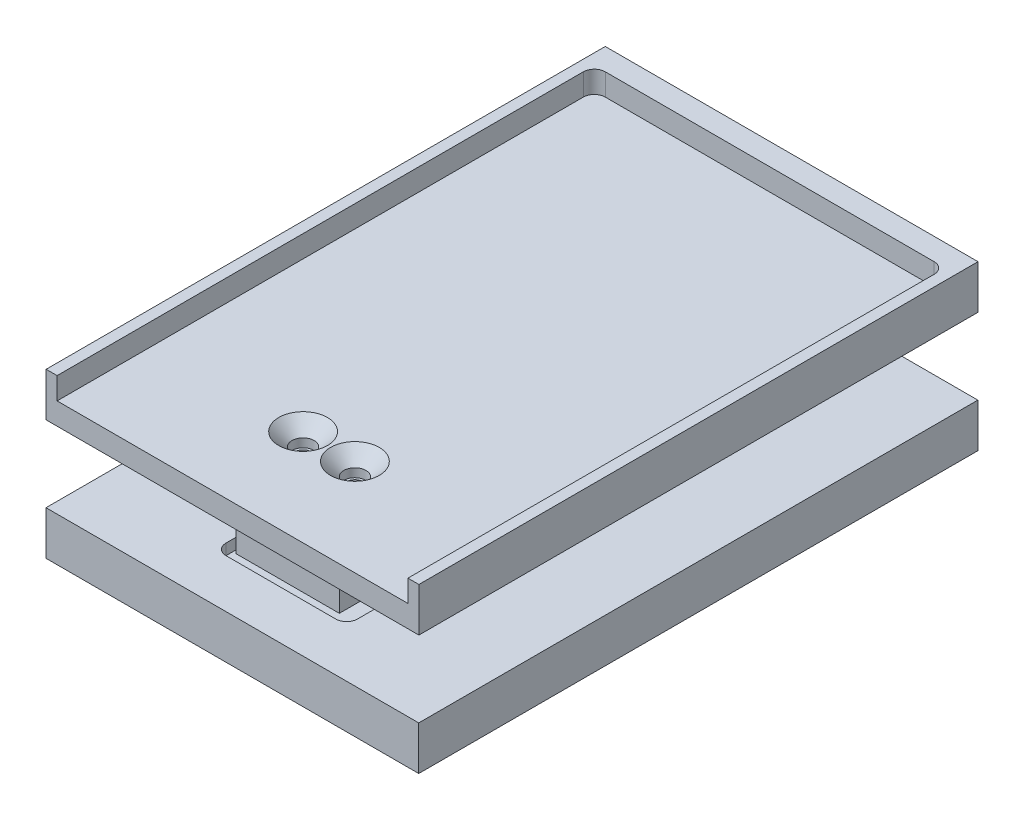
ISO-10303-21;
HEADER;
FILE_DESCRIPTION(('STEP AP214'),'2;1');
FILE_NAME('part.step','',(''),(''),'','','');
FILE_SCHEMA(('AUTOMOTIVE_DESIGN { 1 0 10303 214 1 1 1 1 }'));
ENDSEC;
DATA;
#1=APPLICATION_CONTEXT('core data for automotive mechanical design processes');
#2=APPLICATION_PROTOCOL_DEFINITION('international standard','automotive_design',2000,#1);
#3=PRODUCT_CONTEXT('',#1,'mechanical');
#4=PRODUCT('Part','Part','',(#3));
#5=PRODUCT_RELATED_PRODUCT_CATEGORY('part','',(#4));
#6=PRODUCT_DEFINITION_FORMATION('','',#4);
#7=PRODUCT_DEFINITION_CONTEXT('part definition',#1,'design');
#8=PRODUCT_DEFINITION('design','',#6,#7);
#9=PRODUCT_DEFINITION_SHAPE('','',#8);
#10=(LENGTH_UNIT() NAMED_UNIT(*) SI_UNIT(.MILLI.,.METRE.));
#11=(NAMED_UNIT(*) PLANE_ANGLE_UNIT() SI_UNIT($,.RADIAN.));
#12=(NAMED_UNIT(*) SI_UNIT($,.STERADIAN.) SOLID_ANGLE_UNIT());
#13=UNCERTAINTY_MEASURE_WITH_UNIT(LENGTH_MEASURE(1.E-05),#10,'distance_accuracy_value','');
#14=(GEOMETRIC_REPRESENTATION_CONTEXT(3) GLOBAL_UNCERTAINTY_ASSIGNED_CONTEXT((#13)) GLOBAL_UNIT_ASSIGNED_CONTEXT((#10,
#11,#12)) REPRESENTATION_CONTEXT('',''));
#15=CARTESIAN_POINT('',(0.,0.,0.));
#16=DIRECTION('',(0.,0.,1.));
#17=DIRECTION('',(1.,0.,0.));
#18=AXIS2_PLACEMENT_3D('',#15,#16,#17);
#19=CARTESIAN_POINT('',(64.4031435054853,52.091093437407,495.729218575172));
#20=DIRECTION('',(0.,0.,-1.));
#21=DIRECTION('',(1.,0.,0.));
#22=AXIS2_PLACEMENT_3D('',#19,#20,#21);
#23=PLANE('',#22);
#24=DIRECTION('',(-1.,0.,0.));
#25=VECTOR('',#24,1.);
#26=CARTESIAN_POINT('',(64.4031435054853,64.791093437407,495.729218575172));
#27=LINE('',#26,#25);
#28=CARTESIAN_POINT('',(64.4031435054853,64.791093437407,495.729218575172));
#29=VERTEX_POINT('',#28);
#30=CARTESIAN_POINT('',(-43.5468564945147,64.791093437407,495.729218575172));
#31=VERTEX_POINT('',#30);
#32=EDGE_CURVE('P0_E252',#29,#31,#27,.T.);
#33=ORIENTED_EDGE('',*,*,#32,.T.);
#34=DIRECTION('',(0.,1.,0.));
#35=VECTOR('',#34,1.);
#36=CARTESIAN_POINT('',(-43.5468564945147,52.091093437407,495.729218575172));
#37=LINE('',#36,#35);
#38=CARTESIAN_POINT('',(-43.5468564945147,52.091093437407,495.729218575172));
#39=VERTEX_POINT('',#38);
#40=EDGE_CURVE('P0_E283',#39,#31,#37,.T.);
#41=ORIENTED_EDGE('',*,*,#40,.F.);
#42=DIRECTION('',(-1.,0.,0.));
#43=VECTOR('',#42,1.);
#44=CARTESIAN_POINT('',(64.4031435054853,52.091093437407,495.729218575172));
#45=LINE('',#44,#43);
#46=CARTESIAN_POINT('',(64.4031435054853,52.091093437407,495.729218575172));
#47=VERTEX_POINT('',#46);
#48=EDGE_CURVE('P0_E255',#47,#39,#45,.T.);
#49=ORIENTED_EDGE('',*,*,#48,.F.);
#50=DIRECTION('',(0.,1.,0.));
#51=VECTOR('',#50,1.);
#52=CARTESIAN_POINT('',(64.4031435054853,52.091093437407,495.729218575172));
#53=LINE('',#52,#51);
#54=EDGE_CURVE('P0_E267',#47,#29,#53,.T.);
#55=ORIENTED_EDGE('',*,*,#54,.T.);
#56=EDGE_LOOP('',(#33,#41,#49,#55));
#57=FACE_BOUND('',#56,.T.);
#58=ADVANCED_FACE('P0_F16',(#57),#23,.F.);
#59=CARTESIAN_POINT('',(-43.5468564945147,52.091093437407,495.729218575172));
#60=DIRECTION('',(1.,0.,0.));
#61=DIRECTION('',(0.,0.,1.));
#62=AXIS2_PLACEMENT_3D('',#59,#60,#61);
#63=PLANE('',#62);
#64=DIRECTION('',(0.,0.,-1.));
#65=VECTOR('',#64,1.);
#66=CARTESIAN_POINT('',(-43.5468564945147,64.791093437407,495.729218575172));
#67=LINE('',#66,#65);
#68=CARTESIAN_POINT('',(-43.5468564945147,64.791093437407,333.804218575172));
#69=VERTEX_POINT('',#68);
#70=EDGE_CURVE('P0_E270',#31,#69,#67,.T.);
#71=ORIENTED_EDGE('',*,*,#70,.T.);
#72=DIRECTION('',(0.,1.,0.));
#73=VECTOR('',#72,1.);
#74=CARTESIAN_POINT('',(-43.5468564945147,52.091093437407,333.804218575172));
#75=LINE('',#74,#73);
#76=CARTESIAN_POINT('',(-43.5468564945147,52.091093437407,333.804218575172));
#77=VERTEX_POINT('',#76);
#78=EDGE_CURVE('P0_E280',#77,#69,#75,.T.);
#79=ORIENTED_EDGE('',*,*,#78,.F.);
#80=DIRECTION('',(0.,0.,-1.));
#81=VECTOR('',#80,1.);
#82=CARTESIAN_POINT('',(-43.5468564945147,52.091093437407,495.729218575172));
#83=LINE('',#82,#81);
#84=EDGE_CURVE('P0_E258',#39,#77,#83,.T.);
#85=ORIENTED_EDGE('',*,*,#84,.F.);
#86=ORIENTED_EDGE('',*,*,#40,.T.);
#87=EDGE_LOOP('',(#71,#79,#85,#86));
#88=FACE_BOUND('',#87,.T.);
#89=ADVANCED_FACE('P0_F336',(#88),#63,.F.);
#90=CARTESIAN_POINT('',(64.4031435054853,52.091093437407,333.804218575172));
#91=DIRECTION('',(0.,0.,1.));
#92=DIRECTION('',(-1.,0.,0.));
#93=AXIS2_PLACEMENT_3D('',#90,#91,#92);
#94=PLANE('',#93);
#95=DIRECTION('',(1.,0.,0.));
#96=VECTOR('',#95,1.);
#97=CARTESIAN_POINT('',(64.4031435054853,52.091093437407,333.804218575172));
#98=LINE('',#97,#96);
#99=CARTESIAN_POINT('',(61.2281435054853,52.091093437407,333.804218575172));
#100=VERTEX_POINT('',#99);
#101=CARTESIAN_POINT('',(64.4031435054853,52.091093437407,333.804218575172));
#102=VERTEX_POINT('',#101);
#103=EDGE_CURVE('P0_E261',#100,#102,#98,.T.);
#104=ORIENTED_EDGE('',*,*,#103,.F.);
#105=DIRECTION('',(0.,-1.,0.));
#106=VECTOR('',#105,1.);
#107=CARTESIAN_POINT('',(61.2281435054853,58.441093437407,333.804218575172));
#108=LINE('',#107,#106);
#109=CARTESIAN_POINT('',(61.2281435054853,58.441093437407,333.804218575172));
#110=VERTEX_POINT('',#109);
#111=EDGE_CURVE('P0_E250',#110,#100,#108,.T.);
#112=ORIENTED_EDGE('',*,*,#111,.F.);
#113=DIRECTION('',(1.,0.,0.));
#114=VECTOR('',#113,1.);
#115=CARTESIAN_POINT('',(61.2281435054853,58.441093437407,333.804218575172));
#116=LINE('',#115,#114);
#117=CARTESIAN_POINT('',(-40.3718564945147,58.441093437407,333.804218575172));
#118=VERTEX_POINT('',#117);
#119=EDGE_CURVE('P0_E240',#118,#110,#116,.T.);
#120=ORIENTED_EDGE('',*,*,#119,.F.);
#121=DIRECTION('',(0.,-1.,0.));
#122=VECTOR('',#121,1.);
#123=CARTESIAN_POINT('',(-40.3718564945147,58.441093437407,333.804218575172));
#124=LINE('',#123,#122);
#125=CARTESIAN_POINT('',(-40.3718564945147,52.091093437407,333.804218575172));
#126=VERTEX_POINT('',#125);
#127=EDGE_CURVE('P0_E244',#118,#126,#124,.T.);
#128=ORIENTED_EDGE('',*,*,#127,.T.);
#129=EDGE_CURVE('P0_E262',#77,#126,#98,.T.);
#130=ORIENTED_EDGE('',*,*,#129,.F.);
#131=ORIENTED_EDGE('',*,*,#78,.T.);
#132=DIRECTION('',(1.,0.,0.));
#133=VECTOR('',#132,1.);
#134=CARTESIAN_POINT('',(64.4031435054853,64.791093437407,333.804218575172));
#135=LINE('',#134,#133);
#136=CARTESIAN_POINT('',(64.4031435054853,64.791093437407,333.804218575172));
#137=VERTEX_POINT('',#136);
#138=EDGE_CURVE('P0_E272',#69,#137,#135,.T.);
#139=ORIENTED_EDGE('',*,*,#138,.T.);
#140=DIRECTION('',(0.,1.,0.));
#141=VECTOR('',#140,1.);
#142=CARTESIAN_POINT('',(64.4031435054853,52.091093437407,333.804218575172));
#143=LINE('',#142,#141);
#144=EDGE_CURVE('P0_E277',#102,#137,#143,.T.);
#145=ORIENTED_EDGE('',*,*,#144,.F.);
#146=EDGE_LOOP('',(#104,#112,#120,#128,#130,#131,#139,#145));
#147=FACE_BOUND('',#146,.T.);
#148=ADVANCED_FACE('P0_F320',(#147),#94,.F.);
#149=CARTESIAN_POINT('',(64.4031435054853,52.091093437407,495.729218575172));
#150=DIRECTION('',(-1.,0.,0.));
#151=DIRECTION('',(0.,0.,-1.));
#152=AXIS2_PLACEMENT_3D('',#149,#150,#151);
#153=PLANE('',#152);
#154=DIRECTION('',(0.,0.,1.));
#155=VECTOR('',#154,1.);
#156=CARTESIAN_POINT('',(64.4031435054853,64.791093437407,495.729218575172));
#157=LINE('',#156,#155);
#158=EDGE_CURVE('P0_E259',#137,#29,#157,.T.);
#159=ORIENTED_EDGE('',*,*,#158,.T.);
#160=ORIENTED_EDGE('',*,*,#54,.F.);
#161=DIRECTION('',(0.,0.,1.));
#162=VECTOR('',#161,1.);
#163=CARTESIAN_POINT('',(64.4031435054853,52.091093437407,495.729218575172));
#164=LINE('',#163,#162);
#165=EDGE_CURVE('P0_E265',#102,#47,#164,.T.);
#166=ORIENTED_EDGE('',*,*,#165,.F.);
#167=ORIENTED_EDGE('',*,*,#144,.T.);
#168=EDGE_LOOP('',(#159,#160,#166,#167));
#169=FACE_BOUND('',#168,.T.);
#170=ADVANCED_FACE('P0_F329',(#169),#153,.F.);
#171=CARTESIAN_POINT('',(-43.5468564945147,52.091093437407,495.729218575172));
#172=DIRECTION('',(0.,-1.,0.));
#173=DIRECTION('',(-1.,0.,0.));
#174=AXIS2_PLACEMENT_3D('',#171,#172,#173);
#175=PLANE('',#174);
#176=DIRECTION('',(0.,0.,1.));
#177=VECTOR('',#176,1.);
#178=CARTESIAN_POINT('',(61.2281435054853,52.091093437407,489.379218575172));
#179=LINE('',#178,#177);
#180=CARTESIAN_POINT('',(61.2281435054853,52.091093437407,486.204218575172));
#181=VERTEX_POINT('',#180);
#182=EDGE_CURVE('P0_E238',#100,#181,#179,.T.);
#183=ORIENTED_EDGE('',*,*,#182,.F.);
#184=ORIENTED_EDGE('',*,*,#103,.T.);
#185=ORIENTED_EDGE('',*,*,#165,.T.);
#186=ORIENTED_EDGE('',*,*,#48,.T.);
#187=ORIENTED_EDGE('',*,*,#84,.T.);
#188=ORIENTED_EDGE('',*,*,#129,.T.);
#189=DIRECTION('',(0.,0.,-1.));
#190=VECTOR('',#189,1.);
#191=CARTESIAN_POINT('',(-40.3718564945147,52.091093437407,489.379218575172));
#192=LINE('',#191,#190);
#193=CARTESIAN_POINT('',(-40.3718564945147,52.091093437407,486.204218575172));
#194=VERTEX_POINT('',#193);
#195=EDGE_CURVE('P0_E247',#194,#126,#192,.T.);
#196=ORIENTED_EDGE('',*,*,#195,.F.);
#197=CARTESIAN_POINT('',(-37.1968564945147,52.091093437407,486.204218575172));
#198=DIRECTION('',(0.,-1.,0.));
#199=DIRECTION('',(-1.,0.,0.));
#200=AXIS2_PLACEMENT_3D('',#197,#198,#199);
#201=CIRCLE('',#200,3.175);
#202=CARTESIAN_POINT('',(-37.1968564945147,52.091093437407,489.379218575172));
#203=VERTEX_POINT('',#202);
#204=EDGE_CURVE('P0_E24',#194,#203,#201,.F.);
#205=ORIENTED_EDGE('',*,*,#204,.T.);
#206=DIRECTION('',(-1.,0.,0.));
#207=VECTOR('',#206,1.);
#208=CARTESIAN_POINT('',(61.2281435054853,52.091093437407,489.379218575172));
#209=LINE('',#208,#207);
#210=CARTESIAN_POINT('',(58.0531435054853,52.091093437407,489.379218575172));
#211=VERTEX_POINT('',#210);
#212=EDGE_CURVE('P0_E233',#211,#203,#209,.T.);
#213=ORIENTED_EDGE('',*,*,#212,.F.);
#214=CARTESIAN_POINT('',(58.0531435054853,52.091093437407,486.204218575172));
#215=DIRECTION('',(0.,-1.,0.));
#216=DIRECTION('',(-1.,0.,0.));
#217=AXIS2_PLACEMENT_3D('',#214,#215,#216);
#218=CIRCLE('',#217,3.175);
#219=EDGE_CURVE('P0_E10',#211,#181,#218,.F.);
#220=ORIENTED_EDGE('',*,*,#219,.T.);
#221=EDGE_LOOP('',(#183,#184,#185,#186,#187,#188,#196,#205,#213,#220));
#222=FACE_BOUND('',#221,.T.);
#223=ADVANCED_FACE('P0_F299',(#222),#175,.T.);
#224=CARTESIAN_POINT('',(-43.5468564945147,64.791093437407,495.729218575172));
#225=DIRECTION('',(0.,-1.,0.));
#226=DIRECTION('',(-1.,0.,0.));
#227=AXIS2_PLACEMENT_3D('',#224,#225,#226);
#228=PLANE('',#227);
#229=DIRECTION('',(1.,0.,0.));
#230=VECTOR('',#229,1.);
#231=CARTESIAN_POINT('',(-5.44685649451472,64.791093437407,481.694218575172));
#232=LINE('',#231,#230);
#233=CARTESIAN_POINT('',(-5.44685649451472,64.791093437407,481.694218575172));
#234=VERTEX_POINT('',#233);
#235=CARTESIAN_POINT('',(26.3031435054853,64.791093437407,481.694218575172));
#236=VERTEX_POINT('',#235);
#237=EDGE_CURVE('P0_E186',#234,#236,#232,.T.);
#238=ORIENTED_EDGE('',*,*,#237,.F.);
#239=CARTESIAN_POINT('',(-5.44685649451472,64.791093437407,478.519218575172));
#240=DIRECTION('',(0.,1.,0.));
#241=DIRECTION('',(1.,0.,0.));
#242=AXIS2_PLACEMENT_3D('',#239,#240,#241);
#243=CIRCLE('',#242,3.17500000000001);
#244=CARTESIAN_POINT('',(-8.62185649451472,64.791093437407,478.519218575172));
#245=VERTEX_POINT('',#244);
#246=EDGE_CURVE('P0_E148',#245,#234,#243,.T.);
#247=ORIENTED_EDGE('',*,*,#246,.F.);
#248=DIRECTION('',(0.,0.,1.));
#249=VECTOR('',#248,1.);
#250=CARTESIAN_POINT('',(-8.62185649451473,64.791093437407,376.919218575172));
#251=LINE('',#250,#249);
#252=CARTESIAN_POINT('',(-8.62185649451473,64.791093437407,376.919218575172));
#253=VERTEX_POINT('',#252);
#254=EDGE_CURVE('P0_E166',#253,#245,#251,.T.);
#255=ORIENTED_EDGE('',*,*,#254,.F.);
#256=CARTESIAN_POINT('',(-5.44685649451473,64.791093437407,376.919218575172));
#257=DIRECTION('',(0.,1.,0.));
#258=DIRECTION('',(-1.,0.,0.));
#259=AXIS2_PLACEMENT_3D('',#256,#257,#258);
#260=CIRCLE('',#259,3.175);
#261=CARTESIAN_POINT('',(-5.44685649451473,64.791093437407,373.744218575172));
#262=VERTEX_POINT('',#261);
#263=EDGE_CURVE('P0_E169',#262,#253,#260,.T.);
#264=ORIENTED_EDGE('',*,*,#263,.F.);
#265=DIRECTION('',(-1.,0.,0.));
#266=VECTOR('',#265,1.);
#267=CARTESIAN_POINT('',(-5.44685649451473,64.791093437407,373.744218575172));
#268=LINE('',#267,#266);
#269=CARTESIAN_POINT('',(26.3031435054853,64.791093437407,373.744218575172));
#270=VERTEX_POINT('',#269);
#271=EDGE_CURVE('P0_E197',#270,#262,#268,.T.);
#272=ORIENTED_EDGE('',*,*,#271,.F.);
#273=CARTESIAN_POINT('',(26.3031435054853,64.791093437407,376.919218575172));
#274=DIRECTION('',(0.,1.,0.));
#275=DIRECTION('',(-1.,0.,0.));
#276=AXIS2_PLACEMENT_3D('',#273,#274,#275);
#277=CIRCLE('',#276,3.175);
#278=CARTESIAN_POINT('',(29.4781435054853,64.791093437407,376.919218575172));
#279=VERTEX_POINT('',#278);
#280=EDGE_CURVE('P0_E194',#279,#270,#277,.T.);
#281=ORIENTED_EDGE('',*,*,#280,.F.);
#282=DIRECTION('',(0.,0.,-1.));
#283=VECTOR('',#282,1.);
#284=CARTESIAN_POINT('',(29.4781435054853,64.791093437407,376.919218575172));
#285=LINE('',#284,#283);
#286=CARTESIAN_POINT('',(29.4781435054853,64.791093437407,478.519218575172));
#287=VERTEX_POINT('',#286);
#288=EDGE_CURVE('P0_E191',#287,#279,#285,.T.);
#289=ORIENTED_EDGE('',*,*,#288,.F.);
#290=CARTESIAN_POINT('',(26.3031435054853,64.791093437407,478.519218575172));
#291=DIRECTION('',(0.,1.,0.));
#292=DIRECTION('',(-1.,0.,0.));
#293=AXIS2_PLACEMENT_3D('',#290,#291,#292);
#294=CIRCLE('',#293,3.17499999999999);
#295=EDGE_CURVE('P0_E188',#236,#287,#294,.T.);
#296=ORIENTED_EDGE('',*,*,#295,.F.);
#297=EDGE_LOOP('',(#238,#247,#255,#264,#272,#281,#289,#296));
#298=FACE_BOUND('',#297,.T.);
#299=CARTESIAN_POINT('',(2.92814350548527,64.791093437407,361.744218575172));
#300=DIRECTION('',(0.,-1.,0.));
#301=DIRECTION('',(-1.,0.,0.));
#302=AXIS2_PLACEMENT_3D('',#299,#300,#301);
#303=CIRCLE('',#302,3.2);
#304=CARTESIAN_POINT('',(-0.27185649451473,64.791093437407,361.744218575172));
#305=VERTEX_POINT('',#304);
#306=EDGE_CURVE('P0_E221',#305,#305,#303,.T.);
#307=ORIENTED_EDGE('',*,*,#306,.T.);
#308=EDGE_LOOP('',(#307));
#309=FACE_BOUND('',#308,.T.);
#310=CARTESIAN_POINT('',(17.9281435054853,64.791093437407,361.744218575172));
#311=DIRECTION('',(0.,-1.,0.));
#312=DIRECTION('',(-1.,0.,0.));
#313=AXIS2_PLACEMENT_3D('',#310,#311,#312);
#314=CIRCLE('',#313,3.2);
#315=CARTESIAN_POINT('',(14.7281435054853,64.791093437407,361.744218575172));
#316=VERTEX_POINT('',#315);
#317=EDGE_CURVE('P0_E230',#316,#316,#314,.T.);
#318=ORIENTED_EDGE('',*,*,#317,.T.);
#319=EDGE_LOOP('',(#318));
#320=FACE_BOUND('',#319,.T.);
#321=ORIENTED_EDGE('',*,*,#32,.F.);
#322=ORIENTED_EDGE('',*,*,#158,.F.);
#323=ORIENTED_EDGE('',*,*,#138,.F.);
#324=ORIENTED_EDGE('',*,*,#70,.F.);
#325=EDGE_LOOP('',(#321,#322,#323,#324));
#326=FACE_BOUND('',#325,.T.);
#327=ADVANCED_FACE('P0_F338',(#298,#309,#320,#326),#228,.F.);
#328=CARTESIAN_POINT('',(61.2281435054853,58.441093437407,489.379218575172));
#329=DIRECTION('',(0.,0.,1.));
#330=DIRECTION('',(-1.,0.,0.));
#331=AXIS2_PLACEMENT_3D('',#328,#329,#330);
#332=PLANE('',#331);
#333=ORIENTED_EDGE('',*,*,#212,.T.);
#334=DIRECTION('',(0.,-1.,0.));
#335=VECTOR('',#334,1.);
#336=CARTESIAN_POINT('',(-37.1968564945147,58.441093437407,489.379218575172));
#337=LINE('',#336,#335);
#338=CARTESIAN_POINT('',(-37.1968564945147,58.441093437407,489.379218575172));
#339=VERTEX_POINT('',#338);
#340=EDGE_CURVE('P0_E292',#203,#339,#337,.F.);
#341=ORIENTED_EDGE('',*,*,#340,.T.);
#342=DIRECTION('',(-1.,0.,0.));
#343=VECTOR('',#342,1.);
#344=CARTESIAN_POINT('',(61.2281435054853,58.441093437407,489.379218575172));
#345=LINE('',#344,#343);
#346=CARTESIAN_POINT('',(58.0531435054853,58.441093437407,489.379218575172));
#347=VERTEX_POINT('',#346);
#348=EDGE_CURVE('P0_E234',#347,#339,#345,.T.);
#349=ORIENTED_EDGE('',*,*,#348,.F.);
#350=DIRECTION('',(0.,-1.,0.));
#351=VECTOR('',#350,1.);
#352=CARTESIAN_POINT('',(58.0531435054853,52.091093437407,489.379218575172));
#353=LINE('',#352,#351);
#354=EDGE_CURVE('P0_E289',#347,#211,#353,.T.);
#355=ORIENTED_EDGE('',*,*,#354,.T.);
#356=EDGE_LOOP('',(#333,#341,#349,#355));
#357=FACE_BOUND('',#356,.T.);
#358=ADVANCED_FACE('P0_F304',(#357),#332,.F.);
#359=CARTESIAN_POINT('',(61.2281435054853,58.441093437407,489.379218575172));
#360=DIRECTION('',(1.,0.,0.));
#361=DIRECTION('',(0.,0.,1.));
#362=AXIS2_PLACEMENT_3D('',#359,#360,#361);
#363=PLANE('',#362);
#364=ORIENTED_EDGE('',*,*,#182,.T.);
#365=DIRECTION('',(0.,-1.,0.));
#366=VECTOR('',#365,1.);
#367=CARTESIAN_POINT('',(61.2281435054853,58.441093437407,486.204218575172));
#368=LINE('',#367,#366);
#369=CARTESIAN_POINT('',(61.2281435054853,58.441093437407,486.204218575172));
#370=VERTEX_POINT('',#369);
#371=EDGE_CURVE('P0_E36',#181,#370,#368,.F.);
#372=ORIENTED_EDGE('',*,*,#371,.T.);
#373=DIRECTION('',(0.,0.,1.));
#374=VECTOR('',#373,1.);
#375=CARTESIAN_POINT('',(61.2281435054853,58.441093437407,489.379218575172));
#376=LINE('',#375,#374);
#377=EDGE_CURVE('P0_E242',#110,#370,#376,.T.);
#378=ORIENTED_EDGE('',*,*,#377,.F.);
#379=ORIENTED_EDGE('',*,*,#111,.T.);
#380=EDGE_LOOP('',(#364,#372,#378,#379));
#381=FACE_BOUND('',#380,.T.);
#382=ADVANCED_FACE('P0_F322',(#381),#363,.F.);
#383=CARTESIAN_POINT('',(-40.3718564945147,58.441093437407,489.379218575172));
#384=DIRECTION('',(-1.,0.,0.));
#385=DIRECTION('',(0.,0.,-1.));
#386=AXIS2_PLACEMENT_3D('',#383,#384,#385);
#387=PLANE('',#386);
#388=DIRECTION('',(0.,0.,-1.));
#389=VECTOR('',#388,1.);
#390=CARTESIAN_POINT('',(-40.3718564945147,58.441093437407,489.379218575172));
#391=LINE('',#390,#389);
#392=CARTESIAN_POINT('',(-40.3718564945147,58.441093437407,486.204218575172));
#393=VERTEX_POINT('',#392);
#394=EDGE_CURVE('P0_E237',#393,#118,#391,.T.);
#395=ORIENTED_EDGE('',*,*,#394,.F.);
#396=DIRECTION('',(0.,-1.,0.));
#397=VECTOR('',#396,1.);
#398=CARTESIAN_POINT('',(-40.3718564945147,52.091093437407,486.204218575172));
#399=LINE('',#398,#397);
#400=EDGE_CURVE('P0_E286',#393,#194,#399,.T.);
#401=ORIENTED_EDGE('',*,*,#400,.T.);
#402=ORIENTED_EDGE('',*,*,#195,.T.);
#403=ORIENTED_EDGE('',*,*,#127,.F.);
#404=EDGE_LOOP('',(#395,#401,#402,#403));
#405=FACE_BOUND('',#404,.T.);
#406=ADVANCED_FACE('P0_F314',(#405),#387,.F.);
#407=CARTESIAN_POINT('',(-40.3718564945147,58.441093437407,489.379218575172));
#408=DIRECTION('',(0.,-1.,0.));
#409=DIRECTION('',(-1.,0.,0.));
#410=AXIS2_PLACEMENT_3D('',#407,#408,#409);
#411=PLANE('',#410);
#412=CARTESIAN_POINT('',(2.92814350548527,58.441093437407,361.744218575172));
#413=DIRECTION('',(0.,-1.,0.));
#414=DIRECTION('',(-1.,0.,0.));
#415=AXIS2_PLACEMENT_3D('',#412,#413,#414);
#416=CIRCLE('',#415,7.049998);
#417=CARTESIAN_POINT('',(-4.12185449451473,58.441093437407,361.744218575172));
#418=VERTEX_POINT('',#417);
#419=EDGE_CURVE('P0_E204',#418,#418,#416,.T.);
#420=ORIENTED_EDGE('',*,*,#419,.F.);
#421=EDGE_LOOP('',(#420));
#422=FACE_BOUND('',#421,.T.);
#423=CARTESIAN_POINT('',(17.9281435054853,58.441093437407,361.744218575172));
#424=DIRECTION('',(0.,-1.,0.));
#425=DIRECTION('',(-1.,0.,0.));
#426=AXIS2_PLACEMENT_3D('',#423,#424,#425);
#427=CIRCLE('',#426,7.049998);
#428=CARTESIAN_POINT('',(10.8781455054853,58.441093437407,361.744218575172));
#429=VERTEX_POINT('',#428);
#430=EDGE_CURVE('P0_E224',#429,#429,#427,.T.);
#431=ORIENTED_EDGE('',*,*,#430,.F.);
#432=EDGE_LOOP('',(#431));
#433=FACE_BOUND('',#432,.T.);
#434=ORIENTED_EDGE('',*,*,#348,.T.);
#435=CARTESIAN_POINT('',(-37.1968564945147,58.441093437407,486.204218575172));
#436=DIRECTION('',(0.,-1.,0.));
#437=DIRECTION('',(-1.,0.,0.));
#438=AXIS2_PLACEMENT_3D('',#435,#436,#437);
#439=CIRCLE('',#438,3.175);
#440=EDGE_CURVE('P0_E296',#339,#393,#439,.T.);
#441=ORIENTED_EDGE('',*,*,#440,.T.);
#442=ORIENTED_EDGE('',*,*,#394,.T.);
#443=ORIENTED_EDGE('',*,*,#119,.T.);
#444=ORIENTED_EDGE('',*,*,#377,.T.);
#445=CARTESIAN_POINT('',(58.0531435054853,58.441093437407,486.204218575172));
#446=DIRECTION('',(0.,-1.,0.));
#447=DIRECTION('',(-1.,0.,0.));
#448=AXIS2_PLACEMENT_3D('',#445,#446,#447);
#449=CIRCLE('',#448,3.175);
#450=EDGE_CURVE('P0_E294',#370,#347,#449,.T.);
#451=ORIENTED_EDGE('',*,*,#450,.T.);
#452=EDGE_LOOP('',(#434,#441,#442,#443,#444,#451));
#453=FACE_BOUND('',#452,.T.);
#454=ADVANCED_FACE('P0_F311',(#422,#433,#453),#411,.T.);
#455=CARTESIAN_POINT('',(17.9281435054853,58.441093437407,361.744218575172));
#456=DIRECTION('',(0.,-1.,0.));
#457=DIRECTION('',(-1.,0.,0.));
#458=AXIS2_PLACEMENT_3D('',#455,#456,#457);
#459=CYLINDRICAL_SURFACE('',#458,3.2);
#460=ORIENTED_EDGE('',*,*,#317,.F.);
#461=EDGE_LOOP('',(#460));
#462=FACE_BOUND('',#461,.T.);
#463=CARTESIAN_POINT('',(17.9281435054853,62.291091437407,361.744218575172));
#464=DIRECTION('',(0.,-1.,0.));
#465=DIRECTION('',(-1.,0.,0.));
#466=AXIS2_PLACEMENT_3D('',#463,#464,#465);
#467=CIRCLE('',#466,3.2);
#468=CARTESIAN_POINT('',(14.7281435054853,62.291091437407,361.744218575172));
#469=VERTEX_POINT('',#468);
#470=EDGE_CURVE('P0_E227',#469,#469,#467,.T.);
#471=ORIENTED_EDGE('',*,*,#470,.T.);
#472=EDGE_LOOP('',(#471));
#473=FACE_BOUND('',#472,.T.);
#474=ADVANCED_FACE('P0_F407',(#462,#473),#459,.F.);
#475=CARTESIAN_POINT('',(17.9281435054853,58.441093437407,361.744218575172));
#476=DIRECTION('',(0.,-1.,0.));
#477=DIRECTION('',(-1.,0.,0.));
#478=AXIS2_PLACEMENT_3D('',#475,#476,#477);
#479=CONICAL_SURFACE('',#478,7.049998,0.785398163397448);
#480=ORIENTED_EDGE('',*,*,#470,.F.);
#481=EDGE_LOOP('',(#480));
#482=FACE_BOUND('',#481,.T.);
#483=ORIENTED_EDGE('',*,*,#430,.T.);
#484=EDGE_LOOP('',(#483));
#485=FACE_BOUND('',#484,.T.);
#486=ADVANCED_FACE('P0_F403',(#482,#485),#479,.F.);
#487=CARTESIAN_POINT('',(2.92814350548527,58.441093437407,361.744218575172));
#488=DIRECTION('',(0.,-1.,0.));
#489=DIRECTION('',(-1.,0.,0.));
#490=AXIS2_PLACEMENT_3D('',#487,#488,#489);
#491=CYLINDRICAL_SURFACE('',#490,3.2);
#492=ORIENTED_EDGE('',*,*,#306,.F.);
#493=EDGE_LOOP('',(#492));
#494=FACE_BOUND('',#493,.T.);
#495=CARTESIAN_POINT('',(2.92814350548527,62.291091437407,361.744218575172));
#496=DIRECTION('',(0.,-1.,0.));
#497=DIRECTION('',(-1.,0.,0.));
#498=AXIS2_PLACEMENT_3D('',#495,#496,#497);
#499=CIRCLE('',#498,3.2);
#500=CARTESIAN_POINT('',(-0.27185649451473,62.291091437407,361.744218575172));
#501=VERTEX_POINT('',#500);
#502=EDGE_CURVE('P0_E218',#501,#501,#499,.T.);
#503=ORIENTED_EDGE('',*,*,#502,.T.);
#504=EDGE_LOOP('',(#503));
#505=FACE_BOUND('',#504,.T.);
#506=ADVANCED_FACE('P0_F399',(#494,#505),#491,.F.);
#507=CARTESIAN_POINT('',(2.92814350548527,58.441093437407,361.744218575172));
#508=DIRECTION('',(0.,-1.,0.));
#509=DIRECTION('',(-1.,0.,0.));
#510=AXIS2_PLACEMENT_3D('',#507,#508,#509);
#511=CONICAL_SURFACE('',#510,7.049998,0.785398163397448);
#512=ORIENTED_EDGE('',*,*,#502,.F.);
#513=EDGE_LOOP('',(#512));
#514=FACE_BOUND('',#513,.T.);
#515=ORIENTED_EDGE('',*,*,#419,.T.);
#516=EDGE_LOOP('',(#515));
#517=FACE_BOUND('',#516,.T.);
#518=ADVANCED_FACE('P0_F396',(#514,#517),#511,.F.);
#519=CARTESIAN_POINT('',(-5.44685649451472,61.616093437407,478.519218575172));
#520=DIRECTION('',(0.,1.,0.));
#521=DIRECTION('',(1.,0.,0.));
#522=AXIS2_PLACEMENT_3D('',#519,#520,#521);
#523=CYLINDRICAL_SURFACE('',#522,3.17500000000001);
#524=ORIENTED_EDGE('',*,*,#246,.T.);
#525=DIRECTION('',(0.,1.,0.));
#526=VECTOR('',#525,1.);
#527=CARTESIAN_POINT('',(-5.44685649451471,61.616093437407,481.694218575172));
#528=LINE('',#527,#526);
#529=CARTESIAN_POINT('',(-5.44685649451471,61.616093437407,481.694218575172));
#530=VERTEX_POINT('',#529);
#531=EDGE_CURVE('P0_E141',#530,#234,#528,.T.);
#532=ORIENTED_EDGE('',*,*,#531,.F.);
#533=CARTESIAN_POINT('',(-5.44685649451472,61.616093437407,478.519218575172));
#534=DIRECTION('',(0.,1.,0.));
#535=DIRECTION('',(1.,0.,0.));
#536=AXIS2_PLACEMENT_3D('',#533,#534,#535);
#537=CIRCLE('',#536,3.17500000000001);
#538=CARTESIAN_POINT('',(-8.62185649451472,61.616093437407,478.519218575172));
#539=VERTEX_POINT('',#538);
#540=EDGE_CURVE('P0_E145',#539,#530,#537,.T.);
#541=ORIENTED_EDGE('',*,*,#540,.F.);
#542=DIRECTION('',(0.,1.,0.));
#543=VECTOR('',#542,1.);
#544=CARTESIAN_POINT('',(-8.62185649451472,61.616093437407,478.519218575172));
#545=LINE('',#544,#543);
#546=EDGE_CURVE('P0_E202',#539,#245,#545,.T.);
#547=ORIENTED_EDGE('',*,*,#546,.T.);
#548=EDGE_LOOP('',(#524,#532,#541,#547));
#549=FACE_BOUND('',#548,.T.);
#550=ADVANCED_FACE('P0_F143',(#549),#523,.F.);
#551=CARTESIAN_POINT('',(-8.62185649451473,61.616093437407,376.919218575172));
#552=DIRECTION('',(-1.,0.,0.));
#553=DIRECTION('',(0.,0.,-1.));
#554=AXIS2_PLACEMENT_3D('',#551,#552,#553);
#555=PLANE('',#554);
#556=ORIENTED_EDGE('',*,*,#254,.T.);
#557=ORIENTED_EDGE('',*,*,#546,.F.);
#558=DIRECTION('',(0.,0.,1.));
#559=VECTOR('',#558,1.);
#560=CARTESIAN_POINT('',(-8.62185649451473,61.616093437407,376.919218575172));
#561=LINE('',#560,#559);
#562=CARTESIAN_POINT('',(-8.62185649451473,61.616093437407,376.919218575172));
#563=VERTEX_POINT('',#562);
#564=EDGE_CURVE('P0_E153',#563,#539,#561,.T.);
#565=ORIENTED_EDGE('',*,*,#564,.F.);
#566=DIRECTION('',(0.,1.,0.));
#567=VECTOR('',#566,1.);
#568=CARTESIAN_POINT('',(-8.62185649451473,61.616093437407,376.919218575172));
#569=LINE('',#568,#567);
#570=EDGE_CURVE('P0_E205',#563,#253,#569,.T.);
#571=ORIENTED_EDGE('',*,*,#570,.T.);
#572=EDGE_LOOP('',(#556,#557,#565,#571));
#573=FACE_BOUND('',#572,.T.);
#574=ADVANCED_FACE('P0_F371',(#573),#555,.F.);
#575=CARTESIAN_POINT('',(-5.44685649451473,61.616093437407,376.919218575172));
#576=DIRECTION('',(0.,1.,0.));
#577=DIRECTION('',(1.,0.,0.));
#578=AXIS2_PLACEMENT_3D('',#575,#576,#577);
#579=CYLINDRICAL_SURFACE('',#578,3.175);
#580=ORIENTED_EDGE('',*,*,#263,.T.);
#581=ORIENTED_EDGE('',*,*,#570,.F.);
#582=CARTESIAN_POINT('',(-5.44685649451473,61.616093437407,376.919218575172));
#583=DIRECTION('',(0.,1.,0.));
#584=DIRECTION('',(-1.,0.,0.));
#585=AXIS2_PLACEMENT_3D('',#582,#583,#584);
#586=CIRCLE('',#585,3.175);
#587=CARTESIAN_POINT('',(-5.44685649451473,61.616093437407,373.744218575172));
#588=VERTEX_POINT('',#587);
#589=EDGE_CURVE('P0_E182',#588,#563,#586,.T.);
#590=ORIENTED_EDGE('',*,*,#589,.F.);
#591=DIRECTION('',(0.,1.,0.));
#592=VECTOR('',#591,1.);
#593=CARTESIAN_POINT('',(-5.44685649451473,61.616093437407,373.744218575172));
#594=LINE('',#593,#592);
#595=EDGE_CURVE('P0_E207',#588,#262,#594,.T.);
#596=ORIENTED_EDGE('',*,*,#595,.T.);
#597=EDGE_LOOP('',(#580,#581,#590,#596));
#598=FACE_BOUND('',#597,.T.);
#599=ADVANCED_FACE('P0_F374',(#598),#579,.F.);
#600=CARTESIAN_POINT('',(-5.44685649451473,61.616093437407,373.744218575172));
#601=DIRECTION('',(0.,0.,-1.));
#602=DIRECTION('',(1.,0.,0.));
#603=AXIS2_PLACEMENT_3D('',#600,#601,#602);
#604=PLANE('',#603);
#605=ORIENTED_EDGE('',*,*,#271,.T.);
#606=ORIENTED_EDGE('',*,*,#595,.F.);
#607=DIRECTION('',(-1.,0.,0.));
#608=VECTOR('',#607,1.);
#609=CARTESIAN_POINT('',(-5.44685649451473,61.616093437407,373.744218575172));
#610=LINE('',#609,#608);
#611=CARTESIAN_POINT('',(26.3031435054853,61.616093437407,373.744218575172));
#612=VERTEX_POINT('',#611);
#613=EDGE_CURVE('P0_E179',#612,#588,#610,.T.);
#614=ORIENTED_EDGE('',*,*,#613,.F.);
#615=DIRECTION('',(0.,1.,0.));
#616=VECTOR('',#615,1.);
#617=CARTESIAN_POINT('',(26.3031435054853,61.616093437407,373.744218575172));
#618=LINE('',#617,#616);
#619=EDGE_CURVE('P0_E209',#612,#270,#618,.T.);
#620=ORIENTED_EDGE('',*,*,#619,.T.);
#621=EDGE_LOOP('',(#605,#606,#614,#620));
#622=FACE_BOUND('',#621,.T.);
#623=ADVANCED_FACE('P0_F378',(#622),#604,.F.);
#624=CARTESIAN_POINT('',(26.3031435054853,61.616093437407,376.919218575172));
#625=DIRECTION('',(0.,1.,0.));
#626=DIRECTION('',(1.,0.,0.));
#627=AXIS2_PLACEMENT_3D('',#624,#625,#626);
#628=CYLINDRICAL_SURFACE('',#627,3.175);
#629=ORIENTED_EDGE('',*,*,#280,.T.);
#630=ORIENTED_EDGE('',*,*,#619,.F.);
#631=CARTESIAN_POINT('',(26.3031435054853,61.616093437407,376.919218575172));
#632=DIRECTION('',(0.,1.,0.));
#633=DIRECTION('',(-1.,0.,0.));
#634=AXIS2_PLACEMENT_3D('',#631,#632,#633);
#635=CIRCLE('',#634,3.175);
#636=CARTESIAN_POINT('',(29.4781435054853,61.616093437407,376.919218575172));
#637=VERTEX_POINT('',#636);
#638=EDGE_CURVE('P0_E176',#637,#612,#635,.T.);
#639=ORIENTED_EDGE('',*,*,#638,.F.);
#640=DIRECTION('',(0.,1.,0.));
#641=VECTOR('',#640,1.);
#642=CARTESIAN_POINT('',(29.4781435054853,61.616093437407,376.919218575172));
#643=LINE('',#642,#641);
#644=EDGE_CURVE('P0_E211',#637,#279,#643,.T.);
#645=ORIENTED_EDGE('',*,*,#644,.T.);
#646=EDGE_LOOP('',(#629,#630,#639,#645));
#647=FACE_BOUND('',#646,.T.);
#648=ADVANCED_FACE('P0_F382',(#647),#628,.F.);
#649=CARTESIAN_POINT('',(29.4781435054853,61.616093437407,376.919218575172));
#650=DIRECTION('',(1.,0.,0.));
#651=DIRECTION('',(0.,0.,1.));
#652=AXIS2_PLACEMENT_3D('',#649,#650,#651);
#653=PLANE('',#652);
#654=ORIENTED_EDGE('',*,*,#288,.T.);
#655=ORIENTED_EDGE('',*,*,#644,.F.);
#656=DIRECTION('',(0.,0.,-1.));
#657=VECTOR('',#656,1.);
#658=CARTESIAN_POINT('',(29.4781435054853,61.616093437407,376.919218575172));
#659=LINE('',#658,#657);
#660=CARTESIAN_POINT('',(29.4781435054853,61.616093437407,478.519218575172));
#661=VERTEX_POINT('',#660);
#662=EDGE_CURVE('P0_E173',#661,#637,#659,.T.);
#663=ORIENTED_EDGE('',*,*,#662,.F.);
#664=DIRECTION('',(0.,1.,0.));
#665=VECTOR('',#664,1.);
#666=CARTESIAN_POINT('',(29.4781435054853,61.616093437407,478.519218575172));
#667=LINE('',#666,#665);
#668=EDGE_CURVE('P0_E213',#661,#287,#667,.T.);
#669=ORIENTED_EDGE('',*,*,#668,.T.);
#670=EDGE_LOOP('',(#654,#655,#663,#669));
#671=FACE_BOUND('',#670,.T.);
#672=ADVANCED_FACE('P0_F386',(#671),#653,.F.);
#673=CARTESIAN_POINT('',(26.3031435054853,61.616093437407,478.519218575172));
#674=DIRECTION('',(0.,1.,0.));
#675=DIRECTION('',(1.,0.,0.));
#676=AXIS2_PLACEMENT_3D('',#673,#674,#675);
#677=CYLINDRICAL_SURFACE('',#676,3.17499999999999);
#678=ORIENTED_EDGE('',*,*,#295,.T.);
#679=ORIENTED_EDGE('',*,*,#668,.F.);
#680=CARTESIAN_POINT('',(26.3031435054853,61.616093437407,478.519218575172));
#681=DIRECTION('',(0.,1.,0.));
#682=DIRECTION('',(-1.,0.,0.));
#683=AXIS2_PLACEMENT_3D('',#680,#681,#682);
#684=CIRCLE('',#683,3.17499999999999);
#685=CARTESIAN_POINT('',(26.3031435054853,61.616093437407,481.694218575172));
#686=VERTEX_POINT('',#685);
#687=EDGE_CURVE('P0_E161',#686,#661,#684,.T.);
#688=ORIENTED_EDGE('',*,*,#687,.F.);
#689=DIRECTION('',(0.,1.,0.));
#690=VECTOR('',#689,1.);
#691=CARTESIAN_POINT('',(26.3031435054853,61.616093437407,481.694218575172));
#692=LINE('',#691,#690);
#693=EDGE_CURVE('P0_E152',#686,#236,#692,.T.);
#694=ORIENTED_EDGE('',*,*,#693,.T.);
#695=EDGE_LOOP('',(#678,#679,#688,#694));
#696=FACE_BOUND('',#695,.T.);
#697=ADVANCED_FACE('P0_F368',(#696),#677,.F.);
#698=CARTESIAN_POINT('',(-5.44685649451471,61.616093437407,481.694218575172));
#699=DIRECTION('',(0.,0.,1.));
#700=DIRECTION('',(-1.,0.,0.));
#701=AXIS2_PLACEMENT_3D('',#698,#699,#700);
#702=PLANE('',#701);
#703=ORIENTED_EDGE('',*,*,#237,.T.);
#704=ORIENTED_EDGE('',*,*,#693,.F.);
#705=DIRECTION('',(1.,0.,0.));
#706=VECTOR('',#705,1.);
#707=CARTESIAN_POINT('',(-5.44685649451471,61.616093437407,481.694218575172));
#708=LINE('',#707,#706);
#709=EDGE_CURVE('P0_E156',#530,#686,#708,.T.);
#710=ORIENTED_EDGE('',*,*,#709,.F.);
#711=ORIENTED_EDGE('',*,*,#531,.T.);
#712=EDGE_LOOP('',(#703,#704,#710,#711));
#713=FACE_BOUND('',#712,.T.);
#714=ADVANCED_FACE('P0_F157',(#713),#702,.F.);
#715=CARTESIAN_POINT('',(-5.44685649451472,61.616093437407,478.519218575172));
#716=DIRECTION('',(0.,1.,0.));
#717=DIRECTION('',(1.,0.,0.));
#718=AXIS2_PLACEMENT_3D('',#715,#716,#717);
#719=PLANE('',#718);
#720=ORIENTED_EDGE('',*,*,#540,.T.);
#721=ORIENTED_EDGE('',*,*,#709,.T.);
#722=ORIENTED_EDGE('',*,*,#687,.T.);
#723=ORIENTED_EDGE('',*,*,#662,.T.);
#724=ORIENTED_EDGE('',*,*,#638,.T.);
#725=ORIENTED_EDGE('',*,*,#613,.T.);
#726=ORIENTED_EDGE('',*,*,#589,.T.);
#727=ORIENTED_EDGE('',*,*,#564,.T.);
#728=EDGE_LOOP('',(#720,#721,#722,#723,#724,#725,#726,#727));
#729=FACE_BOUND('',#728,.T.);
#730=ADVANCED_FACE('P0_F163',(#729),#719,.T.);
#731=CARTESIAN_POINT('',(-37.1968564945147,58.441093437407,486.204218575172));
#732=DIRECTION('',(0.,1.,0.));
#733=DIRECTION('',(1.,0.,0.));
#734=AXIS2_PLACEMENT_3D('',#731,#732,#733);
#735=CYLINDRICAL_SURFACE('',#734,3.175);
#736=ORIENTED_EDGE('',*,*,#440,.F.);
#737=ORIENTED_EDGE('',*,*,#340,.F.);
#738=ORIENTED_EDGE('',*,*,#204,.F.);
#739=ORIENTED_EDGE('',*,*,#400,.F.);
#740=EDGE_LOOP('',(#736,#737,#738,#739));
#741=FACE_BOUND('',#740,.T.);
#742=ADVANCED_FACE('P0_F308',(#741),#735,.F.);
#743=CARTESIAN_POINT('',(58.0531435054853,58.441093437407,486.204218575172));
#744=DIRECTION('',(0.,1.,0.));
#745=DIRECTION('',(1.,0.,0.));
#746=AXIS2_PLACEMENT_3D('',#743,#744,#745);
#747=CYLINDRICAL_SURFACE('',#746,3.175);
#748=ORIENTED_EDGE('',*,*,#450,.F.);
#749=ORIENTED_EDGE('',*,*,#371,.F.);
#750=ORIENTED_EDGE('',*,*,#219,.F.);
#751=ORIENTED_EDGE('',*,*,#354,.F.);
#752=EDGE_LOOP('',(#748,#749,#750,#751));
#753=FACE_BOUND('',#752,.T.);
#754=ADVANCED_FACE('P0_F18',(#753),#747,.F.);
#755=CLOSED_SHELL('',(#58,#89,#148,#170,#223,#327,#358,#382,#406,#454,#474,#486,#506,#518,#550,
#574,#599,#623,#648,#672,#697,#714,#730,#742,#754));
#756=MANIFOLD_SOLID_BREP('P0_B1',#755);
#757=CARTESIAN_POINT('',(64.4031435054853,99.491093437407,333.759218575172));
#758=DIRECTION('',(0.,0.,1.));
#759=DIRECTION('',(1.,0.,0.));
#760=AXIS2_PLACEMENT_3D('',#757,#758,#759);
#761=PLANE('',#760);
#762=DIRECTION('',(-1.,0.,0.));
#763=VECTOR('',#762,1.);
#764=CARTESIAN_POINT('',(64.4031435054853,86.791093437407,333.759218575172));
#765=LINE('',#764,#763);
#766=CARTESIAN_POINT('',(64.4031435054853,86.791093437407,333.759218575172));
#767=VERTEX_POINT('',#766);
#768=CARTESIAN_POINT('',(-43.5468564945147,86.791093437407,333.759218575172));
#769=VERTEX_POINT('',#768);
#770=EDGE_CURVE('P1_E253',#767,#769,#765,.T.);
#771=ORIENTED_EDGE('',*,*,#770,.T.);
#772=DIRECTION('',(0.,-1.,0.));
#773=VECTOR('',#772,1.);
#774=CARTESIAN_POINT('',(-43.5468564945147,99.491093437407,333.759218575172));
#775=LINE('',#774,#773);
#776=CARTESIAN_POINT('',(-43.5468564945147,99.491093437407,333.759218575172));
#777=VERTEX_POINT('',#776);
#778=EDGE_CURVE('P1_E284',#777,#769,#775,.T.);
#779=ORIENTED_EDGE('',*,*,#778,.F.);
#780=DIRECTION('',(-1.,0.,0.));
#781=VECTOR('',#780,1.);
#782=CARTESIAN_POINT('',(64.4031435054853,99.491093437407,333.759218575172));
#783=LINE('',#782,#781);
#784=CARTESIAN_POINT('',(64.4031435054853,99.491093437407,333.759218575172));
#785=VERTEX_POINT('',#784);
#786=EDGE_CURVE('P1_E256',#785,#777,#783,.T.);
#787=ORIENTED_EDGE('',*,*,#786,.F.);
#788=DIRECTION('',(0.,-1.,0.));
#789=VECTOR('',#788,1.);
#790=CARTESIAN_POINT('',(64.4031435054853,99.491093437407,333.759218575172));
#791=LINE('',#790,#789);
#792=EDGE_CURVE('P1_E268',#785,#767,#791,.T.);
#793=ORIENTED_EDGE('',*,*,#792,.T.);
#794=EDGE_LOOP('',(#771,#779,#787,#793));
#795=FACE_BOUND('',#794,.T.);
#796=ADVANCED_FACE('P1_F17',(#795),#761,.F.);
#797=CARTESIAN_POINT('',(-43.5468564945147,99.491093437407,333.759218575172));
#798=DIRECTION('',(1.,0.,0.));
#799=DIRECTION('',(0.,0.,-1.));
#800=AXIS2_PLACEMENT_3D('',#797,#798,#799);
#801=PLANE('',#800);
#802=DIRECTION('',(0.,0.,1.));
#803=VECTOR('',#802,1.);
#804=CARTESIAN_POINT('',(-43.5468564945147,86.791093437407,333.759218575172));
#805=LINE('',#804,#803);
#806=CARTESIAN_POINT('',(-43.5468564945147,86.791093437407,495.684218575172));
#807=VERTEX_POINT('',#806);
#808=EDGE_CURVE('P1_E271',#769,#807,#805,.T.);
#809=ORIENTED_EDGE('',*,*,#808,.T.);
#810=DIRECTION('',(0.,-1.,0.));
#811=VECTOR('',#810,1.);
#812=CARTESIAN_POINT('',(-43.5468564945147,99.491093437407,495.684218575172));
#813=LINE('',#812,#811);
#814=CARTESIAN_POINT('',(-43.5468564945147,99.491093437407,495.684218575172));
#815=VERTEX_POINT('',#814);
#816=EDGE_CURVE('P1_E281',#815,#807,#813,.T.);
#817=ORIENTED_EDGE('',*,*,#816,.F.);
#818=DIRECTION('',(0.,0.,1.));
#819=VECTOR('',#818,1.);
#820=CARTESIAN_POINT('',(-43.5468564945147,99.491093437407,333.759218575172));
#821=LINE('',#820,#819);
#822=EDGE_CURVE('P1_E259',#777,#815,#821,.T.);
#823=ORIENTED_EDGE('',*,*,#822,.F.);
#824=ORIENTED_EDGE('',*,*,#778,.T.);
#825=EDGE_LOOP('',(#809,#817,#823,#824));
#826=FACE_BOUND('',#825,.T.);
#827=ADVANCED_FACE('P1_F337',(#826),#801,.F.);
#828=CARTESIAN_POINT('',(64.4031435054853,99.491093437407,495.684218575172));
#829=DIRECTION('',(0.,0.,-1.));
#830=DIRECTION('',(-1.,0.,0.));
#831=AXIS2_PLACEMENT_3D('',#828,#829,#830);
#832=PLANE('',#831);
#833=DIRECTION('',(1.,0.,0.));
#834=VECTOR('',#833,1.);
#835=CARTESIAN_POINT('',(64.4031435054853,99.491093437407,495.684218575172));
#836=LINE('',#835,#834);
#837=CARTESIAN_POINT('',(61.2281435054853,99.491093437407,495.684218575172));
#838=VERTEX_POINT('',#837);
#839=CARTESIAN_POINT('',(64.4031435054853,99.491093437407,495.684218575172));
#840=VERTEX_POINT('',#839);
#841=EDGE_CURVE('P1_E262',#838,#840,#836,.T.);
#842=ORIENTED_EDGE('',*,*,#841,.F.);
#843=DIRECTION('',(0.,1.,0.));
#844=VECTOR('',#843,1.);
#845=CARTESIAN_POINT('',(61.2281435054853,93.141093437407,495.684218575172));
#846=LINE('',#845,#844);
#847=CARTESIAN_POINT('',(61.2281435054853,93.141093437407,495.684218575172));
#848=VERTEX_POINT('',#847);
#849=EDGE_CURVE('P1_E251',#848,#838,#846,.T.);
#850=ORIENTED_EDGE('',*,*,#849,.F.);
#851=DIRECTION('',(1.,0.,0.));
#852=VECTOR('',#851,1.);
#853=CARTESIAN_POINT('',(61.2281435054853,93.141093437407,495.684218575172));
#854=LINE('',#853,#852);
#855=CARTESIAN_POINT('',(-40.3718564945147,93.141093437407,495.684218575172));
#856=VERTEX_POINT('',#855);
#857=EDGE_CURVE('P1_E241',#856,#848,#854,.T.);
#858=ORIENTED_EDGE('',*,*,#857,.F.);
#859=DIRECTION('',(0.,1.,0.));
#860=VECTOR('',#859,1.);
#861=CARTESIAN_POINT('',(-40.3718564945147,93.141093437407,495.684218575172));
#862=LINE('',#861,#860);
#863=CARTESIAN_POINT('',(-40.3718564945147,99.491093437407,495.684218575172));
#864=VERTEX_POINT('',#863);
#865=EDGE_CURVE('P1_E245',#856,#864,#862,.T.);
#866=ORIENTED_EDGE('',*,*,#865,.T.);
#867=EDGE_CURVE('P1_E263',#815,#864,#836,.T.);
#868=ORIENTED_EDGE('',*,*,#867,.F.);
#869=ORIENTED_EDGE('',*,*,#816,.T.);
#870=DIRECTION('',(1.,0.,0.));
#871=VECTOR('',#870,1.);
#872=CARTESIAN_POINT('',(64.4031435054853,86.791093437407,495.684218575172));
#873=LINE('',#872,#871);
#874=CARTESIAN_POINT('',(64.4031435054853,86.791093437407,495.684218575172));
#875=VERTEX_POINT('',#874);
#876=EDGE_CURVE('P1_E273',#807,#875,#873,.T.);
#877=ORIENTED_EDGE('',*,*,#876,.T.);
#878=DIRECTION('',(0.,-1.,0.));
#879=VECTOR('',#878,1.);
#880=CARTESIAN_POINT('',(64.4031435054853,99.491093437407,495.684218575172));
#881=LINE('',#880,#879);
#882=EDGE_CURVE('P1_E278',#840,#875,#881,.T.);
#883=ORIENTED_EDGE('',*,*,#882,.F.);
#884=EDGE_LOOP('',(#842,#850,#858,#866,#868,#869,#877,#883));
#885=FACE_BOUND('',#884,.T.);
#886=ADVANCED_FACE('P1_F321',(#885),#832,.F.);
#887=CARTESIAN_POINT('',(64.4031435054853,99.491093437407,333.759218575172));
#888=DIRECTION('',(-1.,0.,0.));
#889=DIRECTION('',(0.,0.,1.));
#890=AXIS2_PLACEMENT_3D('',#887,#888,#889);
#891=PLANE('',#890);
#892=DIRECTION('',(0.,0.,-1.));
#893=VECTOR('',#892,1.);
#894=CARTESIAN_POINT('',(64.4031435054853,86.791093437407,333.759218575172));
#895=LINE('',#894,#893);
#896=EDGE_CURVE('P1_E260',#875,#767,#895,.T.);
#897=ORIENTED_EDGE('',*,*,#896,.T.);
#898=ORIENTED_EDGE('',*,*,#792,.F.);
#899=DIRECTION('',(0.,0.,-1.));
#900=VECTOR('',#899,1.);
#901=CARTESIAN_POINT('',(64.4031435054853,99.491093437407,333.759218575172));
#902=LINE('',#901,#900);
#903=EDGE_CURVE('P1_E266',#840,#785,#902,.T.);
#904=ORIENTED_EDGE('',*,*,#903,.F.);
#905=ORIENTED_EDGE('',*,*,#882,.T.);
#906=EDGE_LOOP('',(#897,#898,#904,#905));
#907=FACE_BOUND('',#906,.T.);
#908=ADVANCED_FACE('P1_F330',(#907),#891,.F.);
#909=CARTESIAN_POINT('',(-43.5468564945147,99.491093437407,333.759218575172));
#910=DIRECTION('',(0.,1.,0.));
#911=DIRECTION('',(-1.,0.,0.));
#912=AXIS2_PLACEMENT_3D('',#909,#910,#911);
#913=PLANE('',#912);
#914=DIRECTION('',(0.,0.,-1.));
#915=VECTOR('',#914,1.);
#916=CARTESIAN_POINT('',(61.2281435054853,99.491093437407,340.109218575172));
#917=LINE('',#916,#915);
#918=CARTESIAN_POINT('',(61.2281435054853,99.491093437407,343.284218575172));
#919=VERTEX_POINT('',#918);
#920=EDGE_CURVE('P1_E239',#838,#919,#917,.T.);
#921=ORIENTED_EDGE('',*,*,#920,.F.);
#922=ORIENTED_EDGE('',*,*,#841,.T.);
#923=ORIENTED_EDGE('',*,*,#903,.T.);
#924=ORIENTED_EDGE('',*,*,#786,.T.);
#925=ORIENTED_EDGE('',*,*,#822,.T.);
#926=ORIENTED_EDGE('',*,*,#867,.T.);
#927=DIRECTION('',(0.,0.,1.));
#928=VECTOR('',#927,1.);
#929=CARTESIAN_POINT('',(-40.3718564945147,99.491093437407,340.109218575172));
#930=LINE('',#929,#928);
#931=CARTESIAN_POINT('',(-40.3718564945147,99.491093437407,343.284218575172));
#932=VERTEX_POINT('',#931);
#933=EDGE_CURVE('P1_E248',#932,#864,#930,.T.);
#934=ORIENTED_EDGE('',*,*,#933,.F.);
#935=CARTESIAN_POINT('',(-37.1968564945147,99.491093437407,343.284218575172));
#936=DIRECTION('',(0.,1.,0.));
#937=DIRECTION('',(-1.,0.,0.));
#938=AXIS2_PLACEMENT_3D('',#935,#936,#937);
#939=CIRCLE('',#938,3.175);
#940=CARTESIAN_POINT('',(-37.1968564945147,99.491093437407,340.109218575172));
#941=VERTEX_POINT('',#940);
#942=EDGE_CURVE('P1_E25',#932,#941,#939,.F.);
#943=ORIENTED_EDGE('',*,*,#942,.T.);
#944=DIRECTION('',(-1.,0.,0.));
#945=VECTOR('',#944,1.);
#946=CARTESIAN_POINT('',(61.2281435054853,99.491093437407,340.109218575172));
#947=LINE('',#946,#945);
#948=CARTESIAN_POINT('',(58.0531435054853,99.491093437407,340.109218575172));
#949=VERTEX_POINT('',#948);
#950=EDGE_CURVE('P1_E234',#949,#941,#947,.T.);
#951=ORIENTED_EDGE('',*,*,#950,.F.);
#952=CARTESIAN_POINT('',(58.0531435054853,99.491093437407,343.284218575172));
#953=DIRECTION('',(0.,1.,0.));
#954=DIRECTION('',(-1.,0.,0.));
#955=AXIS2_PLACEMENT_3D('',#952,#953,#954);
#956=CIRCLE('',#955,3.175);
#957=EDGE_CURVE('P1_E11',#949,#919,#956,.F.);
#958=ORIENTED_EDGE('',*,*,#957,.T.);
#959=EDGE_LOOP('',(#921,#922,#923,#924,#925,#926,#934,#943,#951,#958));
#960=FACE_BOUND('',#959,.T.);
#961=ADVANCED_FACE('P1_F300',(#960),#913,.T.);
#962=CARTESIAN_POINT('',(-43.5468564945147,86.791093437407,333.759218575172));
#963=DIRECTION('',(0.,1.,0.));
#964=DIRECTION('',(-1.,0.,0.));
#965=AXIS2_PLACEMENT_3D('',#962,#963,#964);
#966=PLANE('',#965);
#967=DIRECTION('',(1.,0.,0.));
#968=VECTOR('',#967,1.);
#969=CARTESIAN_POINT('',(-5.44685649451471,86.791093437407,347.794218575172));
#970=LINE('',#969,#968);
#971=CARTESIAN_POINT('',(-5.44685649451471,86.791093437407,347.794218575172));
#972=VERTEX_POINT('',#971);
#973=CARTESIAN_POINT('',(26.3031435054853,86.791093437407,347.794218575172));
#974=VERTEX_POINT('',#973);
#975=EDGE_CURVE('P1_E187',#972,#974,#970,.T.);
#976=ORIENTED_EDGE('',*,*,#975,.F.);
#977=CARTESIAN_POINT('',(-5.44685649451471,86.791093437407,350.969218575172));
#978=DIRECTION('',(0.,-1.,0.));
#979=DIRECTION('',(1.,0.,0.));
#980=AXIS2_PLACEMENT_3D('',#977,#978,#979);
#981=CIRCLE('',#980,3.17500000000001);
#982=CARTESIAN_POINT('',(-8.62185649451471,86.791093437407,350.969218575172));
#983=VERTEX_POINT('',#982);
#984=EDGE_CURVE('P1_E149',#983,#972,#981,.T.);
#985=ORIENTED_EDGE('',*,*,#984,.F.);
#986=DIRECTION('',(0.,0.,-1.));
#987=VECTOR('',#986,1.);
#988=CARTESIAN_POINT('',(-8.62185649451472,86.791093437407,452.569218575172));
#989=LINE('',#988,#987);
#990=CARTESIAN_POINT('',(-8.62185649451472,86.791093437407,452.569218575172));
#991=VERTEX_POINT('',#990);
#992=EDGE_CURVE('P1_E167',#991,#983,#989,.T.);
#993=ORIENTED_EDGE('',*,*,#992,.F.);
#994=CARTESIAN_POINT('',(-5.44685649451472,86.791093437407,452.569218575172));
#995=DIRECTION('',(0.,-1.,0.));
#996=DIRECTION('',(-1.,0.,0.));
#997=AXIS2_PLACEMENT_3D('',#994,#995,#996);
#998=CIRCLE('',#997,3.175);
#999=CARTESIAN_POINT('',(-5.44685649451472,86.791093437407,455.744218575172));
#1000=VERTEX_POINT('',#999);
#1001=EDGE_CURVE('P1_E170',#1000,#991,#998,.T.);
#1002=ORIENTED_EDGE('',*,*,#1001,.F.);
#1003=DIRECTION('',(-1.,0.,0.));
#1004=VECTOR('',#1003,1.);
#1005=CARTESIAN_POINT('',(-5.44685649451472,86.791093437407,455.744218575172));
#1006=LINE('',#1005,#1004);
#1007=CARTESIAN_POINT('',(26.3031435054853,86.791093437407,455.744218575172));
#1008=VERTEX_POINT('',#1007);
#1009=EDGE_CURVE('P1_E198',#1008,#1000,#1006,.T.);
#1010=ORIENTED_EDGE('',*,*,#1009,.F.);
#1011=CARTESIAN_POINT('',(26.3031435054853,86.791093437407,452.569218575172));
#1012=DIRECTION('',(0.,-1.,0.));
#1013=DIRECTION('',(-1.,0.,0.));
#1014=AXIS2_PLACEMENT_3D('',#1011,#1012,#1013);
#1015=CIRCLE('',#1014,3.175);
#1016=CARTESIAN_POINT('',(29.4781435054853,86.791093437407,452.569218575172));
#1017=VERTEX_POINT('',#1016);
#1018=EDGE_CURVE('P1_E195',#1017,#1008,#1015,.T.);
#1019=ORIENTED_EDGE('',*,*,#1018,.F.);
#1020=DIRECTION('',(0.,0.,1.));
#1021=VECTOR('',#1020,1.);
#1022=CARTESIAN_POINT('',(29.4781435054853,86.791093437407,452.569218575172));
#1023=LINE('',#1022,#1021);
#1024=CARTESIAN_POINT('',(29.4781435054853,86.791093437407,350.969218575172));
#1025=VERTEX_POINT('',#1024);
#1026=EDGE_CURVE('P1_E192',#1025,#1017,#1023,.T.);
#1027=ORIENTED_EDGE('',*,*,#1026,.F.);
#1028=CARTESIAN_POINT('',(26.3031435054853,86.791093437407,350.969218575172));
#1029=DIRECTION('',(0.,-1.,0.));
#1030=DIRECTION('',(-1.,0.,0.));
#1031=AXIS2_PLACEMENT_3D('',#1028,#1029,#1030);
#1032=CIRCLE('',#1031,3.17499999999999);
#1033=EDGE_CURVE('P1_E189',#974,#1025,#1032,.T.);
#1034=ORIENTED_EDGE('',*,*,#1033,.F.);
#1035=EDGE_LOOP('',(#976,#985,#993,#1002,#1010,#1019,#1027,#1034));
#1036=FACE_BOUND('',#1035,.T.);
#1037=CARTESIAN_POINT('',(2.92814350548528,86.791093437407,467.744218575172));
#1038=DIRECTION('',(0.,1.,0.));
#1039=DIRECTION('',(-1.,0.,0.));
#1040=AXIS2_PLACEMENT_3D('',#1037,#1038,#1039);
#1041=CIRCLE('',#1040,3.2);
#1042=CARTESIAN_POINT('',(-0.271856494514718,86.791093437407,467.744218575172));
#1043=VERTEX_POINT('',#1042);
#1044=EDGE_CURVE('P1_E222',#1043,#1043,#1041,.T.);
#1045=ORIENTED_EDGE('',*,*,#1044,.T.);
#1046=EDGE_LOOP('',(#1045));
#1047=FACE_BOUND('',#1046,.T.);
#1048=CARTESIAN_POINT('',(17.9281435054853,86.791093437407,467.744218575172));
#1049=DIRECTION('',(0.,1.,0.));
#1050=DIRECTION('',(-1.,0.,0.));
#1051=AXIS2_PLACEMENT_3D('',#1048,#1049,#1050);
#1052=CIRCLE('',#1051,3.2);
#1053=CARTESIAN_POINT('',(14.7281435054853,86.791093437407,467.744218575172));
#1054=VERTEX_POINT('',#1053);
#1055=EDGE_CURVE('P1_E231',#1054,#1054,#1052,.T.);
#1056=ORIENTED_EDGE('',*,*,#1055,.T.);
#1057=EDGE_LOOP('',(#1056));
#1058=FACE_BOUND('',#1057,.T.);
#1059=ORIENTED_EDGE('',*,*,#770,.F.);
#1060=ORIENTED_EDGE('',*,*,#896,.F.);
#1061=ORIENTED_EDGE('',*,*,#876,.F.);
#1062=ORIENTED_EDGE('',*,*,#808,.F.);
#1063=EDGE_LOOP('',(#1059,#1060,#1061,#1062));
#1064=FACE_BOUND('',#1063,.T.);
#1065=ADVANCED_FACE('P1_F339',(#1036,#1047,#1058,#1064),#966,.F.);
#1066=CARTESIAN_POINT('',(61.2281435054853,93.141093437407,340.109218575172));
#1067=DIRECTION('',(0.,0.,-1.));
#1068=DIRECTION('',(-1.,0.,0.));
#1069=AXIS2_PLACEMENT_3D('',#1066,#1067,#1068);
#1070=PLANE('',#1069);
#1071=ORIENTED_EDGE('',*,*,#950,.T.);
#1072=DIRECTION('',(0.,1.,0.));
#1073=VECTOR('',#1072,1.);
#1074=CARTESIAN_POINT('',(-37.1968564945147,93.141093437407,340.109218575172));
#1075=LINE('',#1074,#1073);
#1076=CARTESIAN_POINT('',(-37.1968564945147,93.141093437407,340.109218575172));
#1077=VERTEX_POINT('',#1076);
#1078=EDGE_CURVE('P1_E293',#941,#1077,#1075,.F.);
#1079=ORIENTED_EDGE('',*,*,#1078,.T.);
#1080=DIRECTION('',(-1.,0.,0.));
#1081=VECTOR('',#1080,1.);
#1082=CARTESIAN_POINT('',(61.2281435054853,93.141093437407,340.109218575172));
#1083=LINE('',#1082,#1081);
#1084=CARTESIAN_POINT('',(58.0531435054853,93.141093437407,340.109218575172));
#1085=VERTEX_POINT('',#1084);
#1086=EDGE_CURVE('P1_E235',#1085,#1077,#1083,.T.);
#1087=ORIENTED_EDGE('',*,*,#1086,.F.);
#1088=DIRECTION('',(0.,1.,0.));
#1089=VECTOR('',#1088,1.);
#1090=CARTESIAN_POINT('',(58.0531435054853,99.491093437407,340.109218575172));
#1091=LINE('',#1090,#1089);
#1092=EDGE_CURVE('P1_E290',#1085,#949,#1091,.T.);
#1093=ORIENTED_EDGE('',*,*,#1092,.T.);
#1094=EDGE_LOOP('',(#1071,#1079,#1087,#1093));
#1095=FACE_BOUND('',#1094,.T.);
#1096=ADVANCED_FACE('P1_F305',(#1095),#1070,.F.);
#1097=CARTESIAN_POINT('',(61.2281435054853,93.141093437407,340.109218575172));
#1098=DIRECTION('',(1.,0.,0.));
#1099=DIRECTION('',(0.,0.,-1.));
#1100=AXIS2_PLACEMENT_3D('',#1097,#1098,#1099);
#1101=PLANE('',#1100);
#1102=ORIENTED_EDGE('',*,*,#920,.T.);
#1103=DIRECTION('',(0.,1.,0.));
#1104=VECTOR('',#1103,1.);
#1105=CARTESIAN_POINT('',(61.2281435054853,93.141093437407,343.284218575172));
#1106=LINE('',#1105,#1104);
#1107=CARTESIAN_POINT('',(61.2281435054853,93.141093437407,343.284218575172));
#1108=VERTEX_POINT('',#1107);
#1109=EDGE_CURVE('P1_E37',#919,#1108,#1106,.F.);
#1110=ORIENTED_EDGE('',*,*,#1109,.T.);
#1111=DIRECTION('',(0.,0.,-1.));
#1112=VECTOR('',#1111,1.);
#1113=CARTESIAN_POINT('',(61.2281435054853,93.141093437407,340.109218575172));
#1114=LINE('',#1113,#1112);
#1115=EDGE_CURVE('P1_E243',#848,#1108,#1114,.T.);
#1116=ORIENTED_EDGE('',*,*,#1115,.F.);
#1117=ORIENTED_EDGE('',*,*,#849,.T.);
#1118=EDGE_LOOP('',(#1102,#1110,#1116,#1117));
#1119=FACE_BOUND('',#1118,.T.);
#1120=ADVANCED_FACE('P1_F323',(#1119),#1101,.F.);
#1121=CARTESIAN_POINT('',(-40.3718564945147,93.141093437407,340.109218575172));
#1122=DIRECTION('',(-1.,0.,0.));
#1123=DIRECTION('',(0.,0.,1.));
#1124=AXIS2_PLACEMENT_3D('',#1121,#1122,#1123);
#1125=PLANE('',#1124);
#1126=DIRECTION('',(0.,0.,1.));
#1127=VECTOR('',#1126,1.);
#1128=CARTESIAN_POINT('',(-40.3718564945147,93.141093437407,340.109218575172));
#1129=LINE('',#1128,#1127);
#1130=CARTESIAN_POINT('',(-40.3718564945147,93.141093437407,343.284218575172));
#1131=VERTEX_POINT('',#1130);
#1132=EDGE_CURVE('P1_E238',#1131,#856,#1129,.T.);
#1133=ORIENTED_EDGE('',*,*,#1132,.F.);
#1134=DIRECTION('',(0.,1.,0.));
#1135=VECTOR('',#1134,1.);
#1136=CARTESIAN_POINT('',(-40.3718564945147,99.491093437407,343.284218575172));
#1137=LINE('',#1136,#1135);
#1138=EDGE_CURVE('P1_E287',#1131,#932,#1137,.T.);
#1139=ORIENTED_EDGE('',*,*,#1138,.T.);
#1140=ORIENTED_EDGE('',*,*,#933,.T.);
#1141=ORIENTED_EDGE('',*,*,#865,.F.);
#1142=EDGE_LOOP('',(#1133,#1139,#1140,#1141));
#1143=FACE_BOUND('',#1142,.T.);
#1144=ADVANCED_FACE('P1_F315',(#1143),#1125,.F.);
#1145=CARTESIAN_POINT('',(-40.3718564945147,93.141093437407,340.109218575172));
#1146=DIRECTION('',(0.,1.,0.));
#1147=DIRECTION('',(-1.,0.,0.));
#1148=AXIS2_PLACEMENT_3D('',#1145,#1146,#1147);
#1149=PLANE('',#1148);
#1150=CARTESIAN_POINT('',(2.92814350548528,93.141093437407,467.744218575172));
#1151=DIRECTION('',(0.,1.,0.));
#1152=DIRECTION('',(-1.,0.,0.));
#1153=AXIS2_PLACEMENT_3D('',#1150,#1151,#1152);
#1154=CIRCLE('',#1153,7.049998);
#1155=CARTESIAN_POINT('',(-4.12185449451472,93.141093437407,467.744218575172));
#1156=VERTEX_POINT('',#1155);
#1157=EDGE_CURVE('P1_E205',#1156,#1156,#1154,.T.);
#1158=ORIENTED_EDGE('',*,*,#1157,.F.);
#1159=EDGE_LOOP('',(#1158));
#1160=FACE_BOUND('',#1159,.T.);
#1161=CARTESIAN_POINT('',(17.9281435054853,93.141093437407,467.744218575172));
#1162=DIRECTION('',(0.,1.,0.));
#1163=DIRECTION('',(-1.,0.,0.));
#1164=AXIS2_PLACEMENT_3D('',#1161,#1162,#1163);
#1165=CIRCLE('',#1164,7.049998);
#1166=CARTESIAN_POINT('',(10.8781455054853,93.141093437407,467.744218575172));
#1167=VERTEX_POINT('',#1166);
#1168=EDGE_CURVE('P1_E225',#1167,#1167,#1165,.T.);
#1169=ORIENTED_EDGE('',*,*,#1168,.F.);
#1170=EDGE_LOOP('',(#1169));
#1171=FACE_BOUND('',#1170,.T.);
#1172=ORIENTED_EDGE('',*,*,#1086,.T.);
#1173=CARTESIAN_POINT('',(-37.1968564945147,93.141093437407,343.284218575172));
#1174=DIRECTION('',(0.,1.,0.));
#1175=DIRECTION('',(-1.,0.,0.));
#1176=AXIS2_PLACEMENT_3D('',#1173,#1174,#1175);
#1177=CIRCLE('',#1176,3.175);
#1178=EDGE_CURVE('P1_E297',#1077,#1131,#1177,.T.);
#1179=ORIENTED_EDGE('',*,*,#1178,.T.);
#1180=ORIENTED_EDGE('',*,*,#1132,.T.);
#1181=ORIENTED_EDGE('',*,*,#857,.T.);
#1182=ORIENTED_EDGE('',*,*,#1115,.T.);
#1183=CARTESIAN_POINT('',(58.0531435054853,93.141093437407,343.284218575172));
#1184=DIRECTION('',(0.,1.,0.));
#1185=DIRECTION('',(-1.,0.,0.));
#1186=AXIS2_PLACEMENT_3D('',#1183,#1184,#1185);
#1187=CIRCLE('',#1186,3.175);
#1188=EDGE_CURVE('P1_E295',#1108,#1085,#1187,.T.);
#1189=ORIENTED_EDGE('',*,*,#1188,.T.);
#1190=EDGE_LOOP('',(#1172,#1179,#1180,#1181,#1182,#1189));
#1191=FACE_BOUND('',#1190,.T.);
#1192=ADVANCED_FACE('P1_F312',(#1160,#1171,#1191),#1149,.T.);
#1193=CARTESIAN_POINT('',(17.9281435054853,93.141093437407,467.744218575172));
#1194=DIRECTION('',(0.,1.,0.));
#1195=DIRECTION('',(-1.,0.,0.));
#1196=AXIS2_PLACEMENT_3D('',#1193,#1194,#1195);
#1197=CYLINDRICAL_SURFACE('',#1196,3.2);
#1198=ORIENTED_EDGE('',*,*,#1055,.F.);
#1199=EDGE_LOOP('',(#1198));
#1200=FACE_BOUND('',#1199,.T.);
#1201=CARTESIAN_POINT('',(17.9281435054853,89.291095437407,467.744218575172));
#1202=DIRECTION('',(0.,1.,0.));
#1203=DIRECTION('',(-1.,0.,0.));
#1204=AXIS2_PLACEMENT_3D('',#1201,#1202,#1203);
#1205=CIRCLE('',#1204,3.2);
#1206=CARTESIAN_POINT('',(14.7281435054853,89.291095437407,467.744218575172));
#1207=VERTEX_POINT('',#1206);
#1208=EDGE_CURVE('P1_E228',#1207,#1207,#1205,.T.);
#1209=ORIENTED_EDGE('',*,*,#1208,.T.);
#1210=EDGE_LOOP('',(#1209));
#1211=FACE_BOUND('',#1210,.T.);
#1212=ADVANCED_FACE('P1_F408',(#1200,#1211),#1197,.F.);
#1213=CARTESIAN_POINT('',(17.9281435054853,93.141093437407,467.744218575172));
#1214=DIRECTION('',(0.,1.,0.));
#1215=DIRECTION('',(-1.,0.,0.));
#1216=AXIS2_PLACEMENT_3D('',#1213,#1214,#1215);
#1217=CONICAL_SURFACE('',#1216,7.049998,0.785398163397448);
#1218=ORIENTED_EDGE('',*,*,#1208,.F.);
#1219=EDGE_LOOP('',(#1218));
#1220=FACE_BOUND('',#1219,.T.);
#1221=ORIENTED_EDGE('',*,*,#1168,.T.);
#1222=EDGE_LOOP('',(#1221));
#1223=FACE_BOUND('',#1222,.T.);
#1224=ADVANCED_FACE('P1_F404',(#1220,#1223),#1217,.F.);
#1225=CARTESIAN_POINT('',(2.92814350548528,93.141093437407,467.744218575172));
#1226=DIRECTION('',(0.,1.,0.));
#1227=DIRECTION('',(-1.,0.,0.));
#1228=AXIS2_PLACEMENT_3D('',#1225,#1226,#1227);
#1229=CYLINDRICAL_SURFACE('',#1228,3.2);
#1230=ORIENTED_EDGE('',*,*,#1044,.F.);
#1231=EDGE_LOOP('',(#1230));
#1232=FACE_BOUND('',#1231,.T.);
#1233=CARTESIAN_POINT('',(2.92814350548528,89.291095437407,467.744218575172));
#1234=DIRECTION('',(0.,1.,0.));
#1235=DIRECTION('',(-1.,0.,0.));
#1236=AXIS2_PLACEMENT_3D('',#1233,#1234,#1235);
#1237=CIRCLE('',#1236,3.2);
#1238=CARTESIAN_POINT('',(-0.271856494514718,89.291095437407,467.744218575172));
#1239=VERTEX_POINT('',#1238);
#1240=EDGE_CURVE('P1_E219',#1239,#1239,#1237,.T.);
#1241=ORIENTED_EDGE('',*,*,#1240,.T.);
#1242=EDGE_LOOP('',(#1241));
#1243=FACE_BOUND('',#1242,.T.);
#1244=ADVANCED_FACE('P1_F400',(#1232,#1243),#1229,.F.);
#1245=CARTESIAN_POINT('',(2.92814350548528,93.141093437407,467.744218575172));
#1246=DIRECTION('',(0.,1.,0.));
#1247=DIRECTION('',(-1.,0.,0.));
#1248=AXIS2_PLACEMENT_3D('',#1245,#1246,#1247);
#1249=CONICAL_SURFACE('',#1248,7.049998,0.785398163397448);
#1250=ORIENTED_EDGE('',*,*,#1240,.F.);
#1251=EDGE_LOOP('',(#1250));
#1252=FACE_BOUND('',#1251,.T.);
#1253=ORIENTED_EDGE('',*,*,#1157,.T.);
#1254=EDGE_LOOP('',(#1253));
#1255=FACE_BOUND('',#1254,.T.);
#1256=ADVANCED_FACE('P1_F397',(#1252,#1255),#1249,.F.);
#1257=CARTESIAN_POINT('',(-5.44685649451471,89.966093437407,350.969218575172));
#1258=DIRECTION('',(0.,-1.,0.));
#1259=DIRECTION('',(1.,0.,0.));
#1260=AXIS2_PLACEMENT_3D('',#1257,#1258,#1259);
#1261=CYLINDRICAL_SURFACE('',#1260,3.17500000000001);
#1262=ORIENTED_EDGE('',*,*,#984,.T.);
#1263=DIRECTION('',(0.,-1.,0.));
#1264=VECTOR('',#1263,1.);
#1265=CARTESIAN_POINT('',(-5.44685649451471,89.966093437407,347.794218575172));
#1266=LINE('',#1265,#1264);
#1267=CARTESIAN_POINT('',(-5.44685649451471,89.966093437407,347.794218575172));
#1268=VERTEX_POINT('',#1267);
#1269=EDGE_CURVE('P1_E142',#1268,#972,#1266,.T.);
#1270=ORIENTED_EDGE('',*,*,#1269,.F.);
#1271=CARTESIAN_POINT('',(-5.44685649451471,89.966093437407,350.969218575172));
#1272=DIRECTION('',(0.,-1.,0.));
#1273=DIRECTION('',(1.,0.,0.));
#1274=AXIS2_PLACEMENT_3D('',#1271,#1272,#1273);
#1275=CIRCLE('',#1274,3.17500000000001);
#1276=CARTESIAN_POINT('',(-8.62185649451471,89.966093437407,350.969218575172));
#1277=VERTEX_POINT('',#1276);
#1278=EDGE_CURVE('P1_E146',#1277,#1268,#1275,.T.);
#1279=ORIENTED_EDGE('',*,*,#1278,.F.);
#1280=DIRECTION('',(0.,-1.,0.));
#1281=VECTOR('',#1280,1.);
#1282=CARTESIAN_POINT('',(-8.62185649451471,89.966093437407,350.969218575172));
#1283=LINE('',#1282,#1281);
#1284=EDGE_CURVE('P1_E203',#1277,#983,#1283,.T.);
#1285=ORIENTED_EDGE('',*,*,#1284,.T.);
#1286=EDGE_LOOP('',(#1262,#1270,#1279,#1285));
#1287=FACE_BOUND('',#1286,.T.);
#1288=ADVANCED_FACE('P1_F144',(#1287),#1261,.F.);
#1289=CARTESIAN_POINT('',(-8.62185649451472,89.966093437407,452.569218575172));
#1290=DIRECTION('',(-1.,0.,0.));
#1291=DIRECTION('',(0.,0.,1.));
#1292=AXIS2_PLACEMENT_3D('',#1289,#1290,#1291);
#1293=PLANE('',#1292);
#1294=ORIENTED_EDGE('',*,*,#992,.T.);
#1295=ORIENTED_EDGE('',*,*,#1284,.F.);
#1296=DIRECTION('',(0.,0.,-1.));
#1297=VECTOR('',#1296,1.);
#1298=CARTESIAN_POINT('',(-8.62185649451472,89.966093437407,452.569218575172));
#1299=LINE('',#1298,#1297);
#1300=CARTESIAN_POINT('',(-8.62185649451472,89.966093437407,452.569218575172));
#1301=VERTEX_POINT('',#1300);
#1302=EDGE_CURVE('P1_E154',#1301,#1277,#1299,.T.);
#1303=ORIENTED_EDGE('',*,*,#1302,.F.);
#1304=DIRECTION('',(0.,-1.,0.));
#1305=VECTOR('',#1304,1.);
#1306=CARTESIAN_POINT('',(-8.62185649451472,89.966093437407,452.569218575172));
#1307=LINE('',#1306,#1305);
#1308=EDGE_CURVE('P1_E206',#1301,#991,#1307,.T.);
#1309=ORIENTED_EDGE('',*,*,#1308,.T.);
#1310=EDGE_LOOP('',(#1294,#1295,#1303,#1309));
#1311=FACE_BOUND('',#1310,.T.);
#1312=ADVANCED_FACE('P1_F372',(#1311),#1293,.F.);
#1313=CARTESIAN_POINT('',(-5.44685649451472,89.966093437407,452.569218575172));
#1314=DIRECTION('',(0.,-1.,0.));
#1315=DIRECTION('',(1.,0.,0.));
#1316=AXIS2_PLACEMENT_3D('',#1313,#1314,#1315);
#1317=CYLINDRICAL_SURFACE('',#1316,3.175);
#1318=ORIENTED_EDGE('',*,*,#1001,.T.);
#1319=ORIENTED_EDGE('',*,*,#1308,.F.);
#1320=CARTESIAN_POINT('',(-5.44685649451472,89.966093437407,452.569218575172));
#1321=DIRECTION('',(0.,-1.,0.));
#1322=DIRECTION('',(-1.,0.,0.));
#1323=AXIS2_PLACEMENT_3D('',#1320,#1321,#1322);
#1324=CIRCLE('',#1323,3.175);
#1325=CARTESIAN_POINT('',(-5.44685649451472,89.966093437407,455.744218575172));
#1326=VERTEX_POINT('',#1325);
#1327=EDGE_CURVE('P1_E183',#1326,#1301,#1324,.T.);
#1328=ORIENTED_EDGE('',*,*,#1327,.F.);
#1329=DIRECTION('',(0.,-1.,0.));
#1330=VECTOR('',#1329,1.);
#1331=CARTESIAN_POINT('',(-5.44685649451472,89.966093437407,455.744218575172));
#1332=LINE('',#1331,#1330);
#1333=EDGE_CURVE('P1_E208',#1326,#1000,#1332,.T.);
#1334=ORIENTED_EDGE('',*,*,#1333,.T.);
#1335=EDGE_LOOP('',(#1318,#1319,#1328,#1334));
#1336=FACE_BOUND('',#1335,.T.);
#1337=ADVANCED_FACE('P1_F375',(#1336),#1317,.F.);
#1338=CARTESIAN_POINT('',(-5.44685649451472,89.966093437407,455.744218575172));
#1339=DIRECTION('',(0.,0.,1.));
#1340=DIRECTION('',(1.,0.,0.));
#1341=AXIS2_PLACEMENT_3D('',#1338,#1339,#1340);
#1342=PLANE('',#1341);
#1343=ORIENTED_EDGE('',*,*,#1009,.T.);
#1344=ORIENTED_EDGE('',*,*,#1333,.F.);
#1345=DIRECTION('',(-1.,0.,0.));
#1346=VECTOR('',#1345,1.);
#1347=CARTESIAN_POINT('',(-5.44685649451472,89.966093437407,455.744218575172));
#1348=LINE('',#1347,#1346);
#1349=CARTESIAN_POINT('',(26.3031435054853,89.966093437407,455.744218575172));
#1350=VERTEX_POINT('',#1349);
#1351=EDGE_CURVE('P1_E180',#1350,#1326,#1348,.T.);
#1352=ORIENTED_EDGE('',*,*,#1351,.F.);
#1353=DIRECTION('',(0.,-1.,0.));
#1354=VECTOR('',#1353,1.);
#1355=CARTESIAN_POINT('',(26.3031435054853,89.966093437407,455.744218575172));
#1356=LINE('',#1355,#1354);
#1357=EDGE_CURVE('P1_E210',#1350,#1008,#1356,.T.);
#1358=ORIENTED_EDGE('',*,*,#1357,.T.);
#1359=EDGE_LOOP('',(#1343,#1344,#1352,#1358));
#1360=FACE_BOUND('',#1359,.T.);
#1361=ADVANCED_FACE('P1_F379',(#1360),#1342,.F.);
#1362=CARTESIAN_POINT('',(26.3031435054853,89.966093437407,452.569218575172));
#1363=DIRECTION('',(0.,-1.,0.));
#1364=DIRECTION('',(1.,0.,0.));
#1365=AXIS2_PLACEMENT_3D('',#1362,#1363,#1364);
#1366=CYLINDRICAL_SURFACE('',#1365,3.175);
#1367=ORIENTED_EDGE('',*,*,#1018,.T.);
#1368=ORIENTED_EDGE('',*,*,#1357,.F.);
#1369=CARTESIAN_POINT('',(26.3031435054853,89.966093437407,452.569218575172));
#1370=DIRECTION('',(0.,-1.,0.));
#1371=DIRECTION('',(-1.,0.,0.));
#1372=AXIS2_PLACEMENT_3D('',#1369,#1370,#1371);
#1373=CIRCLE('',#1372,3.175);
#1374=CARTESIAN_POINT('',(29.4781435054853,89.966093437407,452.569218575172));
#1375=VERTEX_POINT('',#1374);
#1376=EDGE_CURVE('P1_E177',#1375,#1350,#1373,.T.);
#1377=ORIENTED_EDGE('',*,*,#1376,.F.);
#1378=DIRECTION('',(0.,-1.,0.));
#1379=VECTOR('',#1378,1.);
#1380=CARTESIAN_POINT('',(29.4781435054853,89.966093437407,452.569218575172));
#1381=LINE('',#1380,#1379);
#1382=EDGE_CURVE('P1_E212',#1375,#1017,#1381,.T.);
#1383=ORIENTED_EDGE('',*,*,#1382,.T.);
#1384=EDGE_LOOP('',(#1367,#1368,#1377,#1383));
#1385=FACE_BOUND('',#1384,.T.);
#1386=ADVANCED_FACE('P1_F383',(#1385),#1366,.F.);
#1387=CARTESIAN_POINT('',(29.4781435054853,89.966093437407,452.569218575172));
#1388=DIRECTION('',(1.,0.,0.));
#1389=DIRECTION('',(0.,0.,-1.));
#1390=AXIS2_PLACEMENT_3D('',#1387,#1388,#1389);
#1391=PLANE('',#1390);
#1392=ORIENTED_EDGE('',*,*,#1026,.T.);
#1393=ORIENTED_EDGE('',*,*,#1382,.F.);
#1394=DIRECTION('',(0.,0.,1.));
#1395=VECTOR('',#1394,1.);
#1396=CARTESIAN_POINT('',(29.4781435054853,89.966093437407,452.569218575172));
#1397=LINE('',#1396,#1395);
#1398=CARTESIAN_POINT('',(29.4781435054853,89.966093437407,350.969218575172));
#1399=VERTEX_POINT('',#1398);
#1400=EDGE_CURVE('P1_E174',#1399,#1375,#1397,.T.);
#1401=ORIENTED_EDGE('',*,*,#1400,.F.);
#1402=DIRECTION('',(0.,-1.,0.));
#1403=VECTOR('',#1402,1.);
#1404=CARTESIAN_POINT('',(29.4781435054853,89.966093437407,350.969218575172));
#1405=LINE('',#1404,#1403);
#1406=EDGE_CURVE('P1_E214',#1399,#1025,#1405,.T.);
#1407=ORIENTED_EDGE('',*,*,#1406,.T.);
#1408=EDGE_LOOP('',(#1392,#1393,#1401,#1407));
#1409=FACE_BOUND('',#1408,.T.);
#1410=ADVANCED_FACE('P1_F387',(#1409),#1391,.F.);
#1411=CARTESIAN_POINT('',(26.3031435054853,89.966093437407,350.969218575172));
#1412=DIRECTION('',(0.,-1.,0.));
#1413=DIRECTION('',(1.,0.,0.));
#1414=AXIS2_PLACEMENT_3D('',#1411,#1412,#1413);
#1415=CYLINDRICAL_SURFACE('',#1414,3.17499999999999);
#1416=ORIENTED_EDGE('',*,*,#1033,.T.);
#1417=ORIENTED_EDGE('',*,*,#1406,.F.);
#1418=CARTESIAN_POINT('',(26.3031435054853,89.966093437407,350.969218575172));
#1419=DIRECTION('',(0.,-1.,0.));
#1420=DIRECTION('',(-1.,0.,0.));
#1421=AXIS2_PLACEMENT_3D('',#1418,#1419,#1420);
#1422=CIRCLE('',#1421,3.17499999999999);
#1423=CARTESIAN_POINT('',(26.3031435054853,89.966093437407,347.794218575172));
#1424=VERTEX_POINT('',#1423);
#1425=EDGE_CURVE('P1_E162',#1424,#1399,#1422,.T.);
#1426=ORIENTED_EDGE('',*,*,#1425,.F.);
#1427=DIRECTION('',(0.,-1.,0.));
#1428=VECTOR('',#1427,1.);
#1429=CARTESIAN_POINT('',(26.3031435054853,89.966093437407,347.794218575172));
#1430=LINE('',#1429,#1428);
#1431=EDGE_CURVE('P1_E153',#1424,#974,#1430,.T.);
#1432=ORIENTED_EDGE('',*,*,#1431,.T.);
#1433=EDGE_LOOP('',(#1416,#1417,#1426,#1432));
#1434=FACE_BOUND('',#1433,.T.);
#1435=ADVANCED_FACE('P1_F369',(#1434),#1415,.F.);
#1436=CARTESIAN_POINT('',(-5.44685649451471,89.966093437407,347.794218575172));
#1437=DIRECTION('',(0.,0.,-1.));
#1438=DIRECTION('',(-1.,0.,0.));
#1439=AXIS2_PLACEMENT_3D('',#1436,#1437,#1438);
#1440=PLANE('',#1439);
#1441=ORIENTED_EDGE('',*,*,#975,.T.);
#1442=ORIENTED_EDGE('',*,*,#1431,.F.);
#1443=DIRECTION('',(1.,0.,0.));
#1444=VECTOR('',#1443,1.);
#1445=CARTESIAN_POINT('',(-5.44685649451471,89.966093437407,347.794218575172));
#1446=LINE('',#1445,#1444);
#1447=EDGE_CURVE('P1_E157',#1268,#1424,#1446,.T.);
#1448=ORIENTED_EDGE('',*,*,#1447,.F.);
#1449=ORIENTED_EDGE('',*,*,#1269,.T.);
#1450=EDGE_LOOP('',(#1441,#1442,#1448,#1449));
#1451=FACE_BOUND('',#1450,.T.);
#1452=ADVANCED_FACE('P1_F158',(#1451),#1440,.F.);
#1453=CARTESIAN_POINT('',(-5.44685649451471,89.966093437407,350.969218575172));
#1454=DIRECTION('',(0.,-1.,0.));
#1455=DIRECTION('',(1.,0.,0.));
#1456=AXIS2_PLACEMENT_3D('',#1453,#1454,#1455);
#1457=PLANE('',#1456);
#1458=ORIENTED_EDGE('',*,*,#1278,.T.);
#1459=ORIENTED_EDGE('',*,*,#1447,.T.);
#1460=ORIENTED_EDGE('',*,*,#1425,.T.);
#1461=ORIENTED_EDGE('',*,*,#1400,.T.);
#1462=ORIENTED_EDGE('',*,*,#1376,.T.);
#1463=ORIENTED_EDGE('',*,*,#1351,.T.);
#1464=ORIENTED_EDGE('',*,*,#1327,.T.);
#1465=ORIENTED_EDGE('',*,*,#1302,.T.);
#1466=EDGE_LOOP('',(#1458,#1459,#1460,#1461,#1462,#1463,#1464,#1465));
#1467=FACE_BOUND('',#1466,.T.);
#1468=ADVANCED_FACE('P1_F164',(#1467),#1457,.T.);
#1469=CARTESIAN_POINT('',(-37.1968564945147,93.141093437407,343.284218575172));
#1470=DIRECTION('',(0.,-1.,0.));
#1471=DIRECTION('',(1.,0.,0.));
#1472=AXIS2_PLACEMENT_3D('',#1469,#1470,#1471);
#1473=CYLINDRICAL_SURFACE('',#1472,3.175);
#1474=ORIENTED_EDGE('',*,*,#1178,.F.);
#1475=ORIENTED_EDGE('',*,*,#1078,.F.);
#1476=ORIENTED_EDGE('',*,*,#942,.F.);
#1477=ORIENTED_EDGE('',*,*,#1138,.F.);
#1478=EDGE_LOOP('',(#1474,#1475,#1476,#1477));
#1479=FACE_BOUND('',#1478,.T.);
#1480=ADVANCED_FACE('P1_F309',(#1479),#1473,.F.);
#1481=CARTESIAN_POINT('',(58.0531435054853,93.141093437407,343.284218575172));
#1482=DIRECTION('',(0.,-1.,0.));
#1483=DIRECTION('',(1.,0.,0.));
#1484=AXIS2_PLACEMENT_3D('',#1481,#1482,#1483);
#1485=CYLINDRICAL_SURFACE('',#1484,3.175);
#1486=ORIENTED_EDGE('',*,*,#1188,.F.);
#1487=ORIENTED_EDGE('',*,*,#1109,.F.);
#1488=ORIENTED_EDGE('',*,*,#957,.F.);
#1489=ORIENTED_EDGE('',*,*,#1092,.F.);
#1490=EDGE_LOOP('',(#1486,#1487,#1488,#1489));
#1491=FACE_BOUND('',#1490,.T.);
#1492=ADVANCED_FACE('P1_F19',(#1491),#1485,.F.);
#1493=CLOSED_SHELL('',(#796,#827,#886,#908,#961,#1065,#1096,#1120,#1144,#1192,#1212,#1224,#1244,
#1256,#1288,#1312,#1337,#1361,#1386,#1410,#1435,#1452,#1468,#1480,#1492));
#1494=MANIFOLD_SOLID_BREP('P1_B1',#1493);
#1495=CARTESIAN_POINT('',(25.4281435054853,86.791093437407,349.744218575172));
#1496=DIRECTION('',(-1.,0.,0.));
#1497=DIRECTION('',(0.,0.,1.));
#1498=AXIS2_PLACEMENT_3D('',#1495,#1496,#1497);
#1499=PLANE('',#1498);
#1500=DIRECTION('',(0.,0.70710678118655,-0.707106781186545));
#1501=VECTOR('',#1500,1.);
#1502=CARTESIAN_POINT('',(25.4281435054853,64.791093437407,454.344218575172));
#1503=LINE('',#1502,#1501);
#1504=CARTESIAN_POINT('',(25.4281435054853,64.791093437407,454.344218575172));
#1505=VERTEX_POINT('',#1504);
#1506=CARTESIAN_POINT('',(25.4281435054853,65.791093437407,453.344218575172));
#1507=VERTEX_POINT('',#1506);
#1508=EDGE_CURVE('P2_E127',#1505,#1507,#1503,.T.);
#1509=ORIENTED_EDGE('',*,*,#1508,.T.);
#1510=DIRECTION('',(0.,0.,-1.));
#1511=VECTOR('',#1510,1.);
#1512=CARTESIAN_POINT('',(25.4281435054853,65.791093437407,453.344218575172));
#1513=LINE('',#1512,#1511);
#1514=CARTESIAN_POINT('',(25.4281435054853,65.791093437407,376.144218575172));
#1515=VERTEX_POINT('',#1514);
#1516=EDGE_CURVE('P2_E130',#1507,#1515,#1513,.T.);
#1517=ORIENTED_EDGE('',*,*,#1516,.T.);
#1518=DIRECTION('',(0.,-0.70710678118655,-0.707106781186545));
#1519=VECTOR('',#1518,1.);
#1520=CARTESIAN_POINT('',(25.4281435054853,64.791093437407,375.144218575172));
#1521=LINE('',#1520,#1519);
#1522=CARTESIAN_POINT('',(25.4281435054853,64.791093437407,375.144218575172));
#1523=VERTEX_POINT('',#1522);
#1524=EDGE_CURVE('P2_E118',#1515,#1523,#1521,.T.);
#1525=ORIENTED_EDGE('',*,*,#1524,.T.);
#1526=DIRECTION('',(0.,0.,-1.));
#1527=VECTOR('',#1526,1.);
#1528=CARTESIAN_POINT('',(25.4281435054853,64.791093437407,349.744218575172));
#1529=LINE('',#1528,#1527);
#1530=CARTESIAN_POINT('',(25.4281435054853,64.791093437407,349.744218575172));
#1531=VERTEX_POINT('',#1530);
#1532=EDGE_CURVE('P2_E163',#1523,#1531,#1529,.T.);
#1533=ORIENTED_EDGE('',*,*,#1532,.T.);
#1534=DIRECTION('',(0.,-1.,0.));
#1535=VECTOR('',#1534,1.);
#1536=CARTESIAN_POINT('',(25.4281435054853,86.791093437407,349.744218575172));
#1537=LINE('',#1536,#1535);
#1538=CARTESIAN_POINT('',(25.4281435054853,86.791093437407,349.744218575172));
#1539=VERTEX_POINT('',#1538);
#1540=EDGE_CURVE('P2_E11',#1539,#1531,#1537,.T.);
#1541=ORIENTED_EDGE('',*,*,#1540,.F.);
#1542=DIRECTION('',(0.,0.,-1.));
#1543=VECTOR('',#1542,1.);
#1544=CARTESIAN_POINT('',(25.4281435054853,86.791093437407,349.744218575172));
#1545=LINE('',#1544,#1543);
#1546=CARTESIAN_POINT('',(25.4281435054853,86.791093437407,375.144218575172));
#1547=VERTEX_POINT('',#1546);
#1548=EDGE_CURVE('P2_E173',#1547,#1539,#1545,.T.);
#1549=ORIENTED_EDGE('',*,*,#1548,.F.);
#1550=DIRECTION('',(0.,0.70710678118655,-0.707106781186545));
#1551=VECTOR('',#1550,1.);
#1552=CARTESIAN_POINT('',(25.4281435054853,86.791093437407,375.144218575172));
#1553=LINE('',#1552,#1551);
#1554=CARTESIAN_POINT('',(25.4281435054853,85.791093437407,376.144218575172));
#1555=VERTEX_POINT('',#1554);
#1556=EDGE_CURVE('P2_E147',#1555,#1547,#1553,.T.);
#1557=ORIENTED_EDGE('',*,*,#1556,.F.);
#1558=DIRECTION('',(0.,0.,-1.));
#1559=VECTOR('',#1558,1.);
#1560=CARTESIAN_POINT('',(25.4281435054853,85.791093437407,453.344218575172));
#1561=LINE('',#1560,#1559);
#1562=CARTESIAN_POINT('',(25.4281435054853,85.791093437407,453.344218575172));
#1563=VERTEX_POINT('',#1562);
#1564=EDGE_CURVE('P2_E156',#1563,#1555,#1561,.T.);
#1565=ORIENTED_EDGE('',*,*,#1564,.F.);
#1566=DIRECTION('',(0.,-0.70710678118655,-0.707106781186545));
#1567=VECTOR('',#1566,1.);
#1568=CARTESIAN_POINT('',(25.4281435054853,86.791093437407,454.344218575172));
#1569=LINE('',#1568,#1567);
#1570=CARTESIAN_POINT('',(25.4281435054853,86.791093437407,454.344218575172));
#1571=VERTEX_POINT('',#1570);
#1572=EDGE_CURVE('P2_E142',#1571,#1563,#1569,.T.);
#1573=ORIENTED_EDGE('',*,*,#1572,.F.);
#1574=CARTESIAN_POINT('',(25.4281435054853,86.791093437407,479.744218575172));
#1575=VERTEX_POINT('',#1574);
#1576=EDGE_CURVE('P2_E169',#1575,#1571,#1545,.T.);
#1577=ORIENTED_EDGE('',*,*,#1576,.F.);
#1578=DIRECTION('',(0.,-1.,0.));
#1579=VECTOR('',#1578,1.);
#1580=CARTESIAN_POINT('',(25.4281435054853,86.791093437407,479.744218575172));
#1581=LINE('',#1580,#1579);
#1582=CARTESIAN_POINT('',(25.4281435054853,64.791093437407,479.744218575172));
#1583=VERTEX_POINT('',#1582);
#1584=EDGE_CURVE('P2_E181',#1575,#1583,#1581,.T.);
#1585=ORIENTED_EDGE('',*,*,#1584,.T.);
#1586=EDGE_CURVE('P2_E182',#1583,#1505,#1529,.T.);
#1587=ORIENTED_EDGE('',*,*,#1586,.T.);
#1588=EDGE_LOOP('',(#1509,#1517,#1525,#1533,#1541,#1549,#1557,#1565,#1573,#1577,#1585,#1587));
#1589=FACE_BOUND('',#1588,.T.);
#1590=ADVANCED_FACE('P2_F17',(#1589),#1499,.F.);
#1591=CARTESIAN_POINT('',(-4.57185649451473,86.791093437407,349.744218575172));
#1592=DIRECTION('',(1.,0.,0.));
#1593=DIRECTION('',(0.,0.,-1.));
#1594=AXIS2_PLACEMENT_3D('',#1591,#1592,#1593);
#1595=PLANE('',#1594);
#1596=DIRECTION('',(0.,0.70710678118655,-0.707106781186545));
#1597=VECTOR('',#1596,1.);
#1598=CARTESIAN_POINT('',(-4.57185649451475,64.791093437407,454.344218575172));
#1599=LINE('',#1598,#1597);
#1600=CARTESIAN_POINT('',(-4.57185649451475,64.791093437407,454.344218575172));
#1601=VERTEX_POINT('',#1600);
#1602=CARTESIAN_POINT('',(-4.57185649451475,65.791093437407,453.344218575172));
#1603=VERTEX_POINT('',#1602);
#1604=EDGE_CURVE('P2_E114',#1601,#1603,#1599,.T.);
#1605=ORIENTED_EDGE('',*,*,#1604,.F.);
#1606=DIRECTION('',(0.,0.,1.));
#1607=VECTOR('',#1606,1.);
#1608=CARTESIAN_POINT('',(-4.57185649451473,64.791093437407,349.744218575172));
#1609=LINE('',#1608,#1607);
#1610=CARTESIAN_POINT('',(-4.57185649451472,64.791093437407,479.744218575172));
#1611=VERTEX_POINT('',#1610);
#1612=EDGE_CURVE('P2_E187',#1601,#1611,#1609,.T.);
#1613=ORIENTED_EDGE('',*,*,#1612,.T.);
#1614=DIRECTION('',(0.,-1.,0.));
#1615=VECTOR('',#1614,1.);
#1616=CARTESIAN_POINT('',(-4.57185649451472,86.791093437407,479.744218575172));
#1617=LINE('',#1616,#1615);
#1618=CARTESIAN_POINT('',(-4.57185649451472,86.791093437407,479.744218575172));
#1619=VERTEX_POINT('',#1618);
#1620=EDGE_CURVE('P2_E193',#1619,#1611,#1617,.T.);
#1621=ORIENTED_EDGE('',*,*,#1620,.F.);
#1622=DIRECTION('',(0.,0.,1.));
#1623=VECTOR('',#1622,1.);
#1624=CARTESIAN_POINT('',(-4.57185649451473,86.791093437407,349.744218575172));
#1625=LINE('',#1624,#1623);
#1626=CARTESIAN_POINT('',(-4.57185649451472,86.791093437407,454.344218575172));
#1627=VERTEX_POINT('',#1626);
#1628=EDGE_CURVE('P2_E175',#1627,#1619,#1625,.T.);
#1629=ORIENTED_EDGE('',*,*,#1628,.F.);
#1630=DIRECTION('',(0.,-0.70710678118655,-0.707106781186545));
#1631=VECTOR('',#1630,1.);
#1632=CARTESIAN_POINT('',(-4.57185649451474,86.791093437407,454.344218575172));
#1633=LINE('',#1632,#1631);
#1634=CARTESIAN_POINT('',(-4.57185649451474,85.791093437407,453.344218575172));
#1635=VERTEX_POINT('',#1634);
#1636=EDGE_CURVE('P2_E39',#1627,#1635,#1633,.T.);
#1637=ORIENTED_EDGE('',*,*,#1636,.T.);
#1638=DIRECTION('',(0.,0.,-1.));
#1639=VECTOR('',#1638,1.);
#1640=CARTESIAN_POINT('',(-4.57185649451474,85.791093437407,453.344218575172));
#1641=LINE('',#1640,#1639);
#1642=CARTESIAN_POINT('',(-4.57185649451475,85.791093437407,376.144218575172));
#1643=VERTEX_POINT('',#1642);
#1644=EDGE_CURVE('P2_E146',#1635,#1643,#1641,.T.);
#1645=ORIENTED_EDGE('',*,*,#1644,.T.);
#1646=DIRECTION('',(0.,0.70710678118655,-0.707106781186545));
#1647=VECTOR('',#1646,1.);
#1648=CARTESIAN_POINT('',(-4.57185649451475,86.791093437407,375.144218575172));
#1649=LINE('',#1648,#1647);
#1650=CARTESIAN_POINT('',(-4.57185649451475,86.791093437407,375.144218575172));
#1651=VERTEX_POINT('',#1650);
#1652=EDGE_CURVE('P2_E150',#1643,#1651,#1649,.T.);
#1653=ORIENTED_EDGE('',*,*,#1652,.T.);
#1654=CARTESIAN_POINT('',(-4.57185649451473,86.791093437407,349.744218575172));
#1655=VERTEX_POINT('',#1654);
#1656=EDGE_CURVE('P2_E176',#1655,#1651,#1625,.T.);
#1657=ORIENTED_EDGE('',*,*,#1656,.F.);
#1658=DIRECTION('',(0.,-1.,0.));
#1659=VECTOR('',#1658,1.);
#1660=CARTESIAN_POINT('',(-4.57185649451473,86.791093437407,349.744218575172));
#1661=LINE('',#1660,#1659);
#1662=CARTESIAN_POINT('',(-4.57185649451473,64.791093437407,349.744218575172));
#1663=VERTEX_POINT('',#1662);
#1664=EDGE_CURVE('P2_E24',#1655,#1663,#1661,.T.);
#1665=ORIENTED_EDGE('',*,*,#1664,.T.);
#1666=CARTESIAN_POINT('',(-4.57185649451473,64.791093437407,375.144218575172));
#1667=VERTEX_POINT('',#1666);
#1668=EDGE_CURVE('P2_E126',#1663,#1667,#1609,.T.);
#1669=ORIENTED_EDGE('',*,*,#1668,.T.);
#1670=DIRECTION('',(0.,-0.70710678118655,-0.707106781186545));
#1671=VECTOR('',#1670,1.);
#1672=CARTESIAN_POINT('',(-4.57185649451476,64.791093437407,375.144218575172));
#1673=LINE('',#1672,#1671);
#1674=CARTESIAN_POINT('',(-4.57185649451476,65.791093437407,376.144218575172));
#1675=VERTEX_POINT('',#1674);
#1676=EDGE_CURVE('P2_E31',#1675,#1667,#1673,.T.);
#1677=ORIENTED_EDGE('',*,*,#1676,.F.);
#1678=DIRECTION('',(0.,0.,-1.));
#1679=VECTOR('',#1678,1.);
#1680=CARTESIAN_POINT('',(-4.57185649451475,65.791093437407,453.344218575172));
#1681=LINE('',#1680,#1679);
#1682=EDGE_CURVE('P2_E106',#1603,#1675,#1681,.T.);
#1683=ORIENTED_EDGE('',*,*,#1682,.F.);
#1684=EDGE_LOOP('',(#1605,#1613,#1621,#1629,#1637,#1645,#1653,#1657,#1665,#1669,#1677,#1683));
#1685=FACE_BOUND('',#1684,.T.);
#1686=ADVANCED_FACE('P2_F123',(#1685),#1595,.F.);
#1687=CARTESIAN_POINT('',(25.4281435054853,64.791093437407,479.744218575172));
#1688=DIRECTION('',(0.,1.,0.));
#1689=DIRECTION('',(0.,0.,1.));
#1690=AXIS2_PLACEMENT_3D('',#1687,#1688,#1689);
#1691=PLANE('',#1690);
#1692=CARTESIAN_POINT('',(2.92814350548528,64.791093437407,467.744218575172));
#1693=DIRECTION('',(0.,1.,0.));
#1694=DIRECTION('',(0.,0.,1.));
#1695=AXIS2_PLACEMENT_3D('',#1692,#1693,#1694);
#1696=CIRCLE('',#1695,2.49999999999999);
#1697=CARTESIAN_POINT('',(2.92814350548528,64.791093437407,470.244218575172));
#1698=VERTEX_POINT('',#1697);
#1699=EDGE_CURVE('P2_E288',#1698,#1698,#1696,.T.);
#1700=ORIENTED_EDGE('',*,*,#1699,.T.);
#1701=EDGE_LOOP('',(#1700));
#1702=FACE_BOUND('',#1701,.T.);
#1703=CARTESIAN_POINT('',(17.9281435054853,64.791093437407,467.744218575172));
#1704=DIRECTION('',(0.,1.,0.));
#1705=DIRECTION('',(0.,0.,1.));
#1706=AXIS2_PLACEMENT_3D('',#1703,#1704,#1705);
#1707=CIRCLE('',#1706,2.49999999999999);
#1708=CARTESIAN_POINT('',(17.9281435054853,64.791093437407,470.244218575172));
#1709=VERTEX_POINT('',#1708);
#1710=EDGE_CURVE('P2_E298',#1709,#1709,#1707,.T.);
#1711=ORIENTED_EDGE('',*,*,#1710,.T.);
#1712=EDGE_LOOP('',(#1711));
#1713=FACE_BOUND('',#1712,.T.);
#1714=DIRECTION('',(1.,0.,0.));
#1715=VECTOR('',#1714,1.);
#1716=CARTESIAN_POINT('',(-4.57185649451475,64.791093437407,454.344218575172));
#1717=LINE('',#1716,#1715);
#1718=EDGE_CURVE('P2_E139',#1601,#1505,#1717,.T.);
#1719=ORIENTED_EDGE('',*,*,#1718,.T.);
#1720=ORIENTED_EDGE('',*,*,#1586,.F.);
#1721=DIRECTION('',(1.,0.,0.));
#1722=VECTOR('',#1721,1.);
#1723=CARTESIAN_POINT('',(-4.57185649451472,64.791093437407,479.744218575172));
#1724=LINE('',#1723,#1722);
#1725=EDGE_CURVE('P2_E189',#1611,#1583,#1724,.T.);
#1726=ORIENTED_EDGE('',*,*,#1725,.F.);
#1727=ORIENTED_EDGE('',*,*,#1612,.F.);
#1728=EDGE_LOOP('',(#1719,#1720,#1726,#1727));
#1729=FACE_BOUND('',#1728,.T.);
#1730=ADVANCED_FACE('P2_F210',(#1702,#1713,#1729),#1691,.F.);
#1731=CARTESIAN_POINT('',(2.92814350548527,64.791093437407,361.744218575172));
#1732=DIRECTION('',(0.,1.,0.));
#1733=DIRECTION('',(0.,0.,1.));
#1734=AXIS2_PLACEMENT_3D('',#1731,#1732,#1733);
#1735=CIRCLE('',#1734,2.49999999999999);
#1736=CARTESIAN_POINT('',(2.92814350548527,64.791093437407,364.244218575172));
#1737=VERTEX_POINT('',#1736);
#1738=EDGE_CURVE('P2_E304',#1737,#1737,#1735,.T.);
#1739=ORIENTED_EDGE('',*,*,#1738,.T.);
#1740=EDGE_LOOP('',(#1739));
#1741=FACE_BOUND('',#1740,.T.);
#1742=CARTESIAN_POINT('',(17.9281435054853,64.791093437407,361.744218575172));
#1743=DIRECTION('',(0.,1.,0.));
#1744=DIRECTION('',(0.,0.,1.));
#1745=AXIS2_PLACEMENT_3D('',#1742,#1743,#1744);
#1746=CIRCLE('',#1745,2.49999999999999);
#1747=CARTESIAN_POINT('',(17.9281435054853,64.791093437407,364.244218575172));
#1748=VERTEX_POINT('',#1747);
#1749=EDGE_CURVE('P2_E133',#1748,#1748,#1746,.T.);
#1750=ORIENTED_EDGE('',*,*,#1749,.T.);
#1751=EDGE_LOOP('',(#1750));
#1752=FACE_BOUND('',#1751,.T.);
#1753=DIRECTION('',(1.,0.,0.));
#1754=VECTOR('',#1753,1.);
#1755=CARTESIAN_POINT('',(-4.57185649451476,64.791093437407,375.144218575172));
#1756=LINE('',#1755,#1754);
#1757=EDGE_CURVE('P2_E120',#1667,#1523,#1756,.T.);
#1758=ORIENTED_EDGE('',*,*,#1757,.F.);
#1759=ORIENTED_EDGE('',*,*,#1668,.F.);
#1760=DIRECTION('',(-1.,0.,0.));
#1761=VECTOR('',#1760,1.);
#1762=CARTESIAN_POINT('',(-4.57185649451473,64.791093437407,349.744218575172));
#1763=LINE('',#1762,#1761);
#1764=EDGE_CURVE('P2_E185',#1531,#1663,#1763,.T.);
#1765=ORIENTED_EDGE('',*,*,#1764,.F.);
#1766=ORIENTED_EDGE('',*,*,#1532,.F.);
#1767=EDGE_LOOP('',(#1758,#1759,#1765,#1766));
#1768=FACE_BOUND('',#1767,.T.);
#1769=ADVANCED_FACE('P2_F201',(#1741,#1752,#1768),#1691,.F.);
#1770=CARTESIAN_POINT('',(25.4281435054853,86.791093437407,479.744218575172));
#1771=DIRECTION('',(0.,1.,0.));
#1772=DIRECTION('',(0.,0.,1.));
#1773=AXIS2_PLACEMENT_3D('',#1770,#1771,#1772);
#1774=PLANE('',#1773);
#1775=CARTESIAN_POINT('',(2.92814350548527,86.791093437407,361.744218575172));
#1776=DIRECTION('',(0.,1.,0.));
#1777=DIRECTION('',(0.,0.,1.));
#1778=AXIS2_PLACEMENT_3D('',#1775,#1776,#1777);
#1779=CIRCLE('',#1778,2.5);
#1780=CARTESIAN_POINT('',(2.92814350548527,86.791093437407,364.244218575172));
#1781=VERTEX_POINT('',#1780);
#1782=EDGE_CURVE('P2_E301',#1781,#1781,#1779,.T.);
#1783=ORIENTED_EDGE('',*,*,#1782,.F.);
#1784=EDGE_LOOP('',(#1783));
#1785=FACE_BOUND('',#1784,.T.);
#1786=CARTESIAN_POINT('',(17.9281435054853,86.791093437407,361.744218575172));
#1787=DIRECTION('',(0.,1.,0.));
#1788=DIRECTION('',(0.,0.,1.));
#1789=AXIS2_PLACEMENT_3D('',#1786,#1787,#1788);
#1790=CIRCLE('',#1789,2.5);
#1791=CARTESIAN_POINT('',(17.9281435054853,86.791093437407,364.244218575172));
#1792=VERTEX_POINT('',#1791);
#1793=EDGE_CURVE('P2_E306',#1792,#1792,#1790,.T.);
#1794=ORIENTED_EDGE('',*,*,#1793,.F.);
#1795=EDGE_LOOP('',(#1794));
#1796=FACE_BOUND('',#1795,.T.);
#1797=DIRECTION('',(1.,0.,0.));
#1798=VECTOR('',#1797,1.);
#1799=CARTESIAN_POINT('',(-4.57185649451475,86.791093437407,375.144218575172));
#1800=LINE('',#1799,#1798);
#1801=EDGE_CURVE('P2_E160',#1651,#1547,#1800,.T.);
#1802=ORIENTED_EDGE('',*,*,#1801,.T.);
#1803=ORIENTED_EDGE('',*,*,#1548,.T.);
#1804=DIRECTION('',(-1.,0.,0.));
#1805=VECTOR('',#1804,1.);
#1806=CARTESIAN_POINT('',(-4.57185649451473,86.791093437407,349.744218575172));
#1807=LINE('',#1806,#1805);
#1808=EDGE_CURVE('P2_E172',#1539,#1655,#1807,.T.);
#1809=ORIENTED_EDGE('',*,*,#1808,.T.);
#1810=ORIENTED_EDGE('',*,*,#1656,.T.);
#1811=EDGE_LOOP('',(#1802,#1803,#1809,#1810));
#1812=FACE_BOUND('',#1811,.T.);
#1813=ADVANCED_FACE('P2_F231',(#1785,#1796,#1812),#1774,.T.);
#1814=CARTESIAN_POINT('',(-4.57185649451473,86.791093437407,349.744218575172));
#1815=DIRECTION('',(0.,0.,1.));
#1816=DIRECTION('',(1.,0.,0.));
#1817=AXIS2_PLACEMENT_3D('',#1814,#1815,#1816);
#1818=PLANE('',#1817);
#1819=ORIENTED_EDGE('',*,*,#1764,.T.);
#1820=ORIENTED_EDGE('',*,*,#1664,.F.);
#1821=ORIENTED_EDGE('',*,*,#1808,.F.);
#1822=ORIENTED_EDGE('',*,*,#1540,.T.);
#1823=EDGE_LOOP('',(#1819,#1820,#1821,#1822));
#1824=FACE_BOUND('',#1823,.T.);
#1825=ADVANCED_FACE('P2_F232',(#1824),#1818,.F.);
#1826=CARTESIAN_POINT('',(-4.57185649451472,86.791093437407,479.744218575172));
#1827=DIRECTION('',(0.,0.,-1.));
#1828=DIRECTION('',(-1.,0.,0.));
#1829=AXIS2_PLACEMENT_3D('',#1826,#1827,#1828);
#1830=PLANE('',#1829);
#1831=ORIENTED_EDGE('',*,*,#1725,.T.);
#1832=ORIENTED_EDGE('',*,*,#1584,.F.);
#1833=DIRECTION('',(1.,0.,0.));
#1834=VECTOR('',#1833,1.);
#1835=CARTESIAN_POINT('',(-4.57185649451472,86.791093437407,479.744218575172));
#1836=LINE('',#1835,#1834);
#1837=EDGE_CURVE('P2_E179',#1619,#1575,#1836,.T.);
#1838=ORIENTED_EDGE('',*,*,#1837,.F.);
#1839=ORIENTED_EDGE('',*,*,#1620,.T.);
#1840=EDGE_LOOP('',(#1831,#1832,#1838,#1839));
#1841=FACE_BOUND('',#1840,.T.);
#1842=ADVANCED_FACE('P2_F216',(#1841),#1830,.F.);
#1843=CARTESIAN_POINT('',(2.92814350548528,86.791093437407,467.744218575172));
#1844=DIRECTION('',(0.,1.,0.));
#1845=DIRECTION('',(0.,0.,1.));
#1846=AXIS2_PLACEMENT_3D('',#1843,#1844,#1845);
#1847=CIRCLE('',#1846,2.5);
#1848=CARTESIAN_POINT('',(2.92814350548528,86.791093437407,470.244218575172));
#1849=VERTEX_POINT('',#1848);
#1850=EDGE_CURVE('P2_E291',#1849,#1849,#1847,.T.);
#1851=ORIENTED_EDGE('',*,*,#1850,.F.);
#1852=EDGE_LOOP('',(#1851));
#1853=FACE_BOUND('',#1852,.T.);
#1854=CARTESIAN_POINT('',(17.9281435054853,86.791093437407,467.744218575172));
#1855=DIRECTION('',(0.,1.,0.));
#1856=DIRECTION('',(0.,0.,1.));
#1857=AXIS2_PLACEMENT_3D('',#1854,#1855,#1856);
#1858=CIRCLE('',#1857,2.5);
#1859=CARTESIAN_POINT('',(17.9281435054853,86.791093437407,470.244218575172));
#1860=VERTEX_POINT('',#1859);
#1861=EDGE_CURVE('P2_E293',#1860,#1860,#1858,.T.);
#1862=ORIENTED_EDGE('',*,*,#1861,.F.);
#1863=EDGE_LOOP('',(#1862));
#1864=FACE_BOUND('',#1863,.T.);
#1865=DIRECTION('',(1.,0.,0.));
#1866=VECTOR('',#1865,1.);
#1867=CARTESIAN_POINT('',(-4.57185649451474,86.791093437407,454.344218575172));
#1868=LINE('',#1867,#1866);
#1869=EDGE_CURVE('P2_E153',#1627,#1571,#1868,.T.);
#1870=ORIENTED_EDGE('',*,*,#1869,.F.);
#1871=ORIENTED_EDGE('',*,*,#1628,.T.);
#1872=ORIENTED_EDGE('',*,*,#1837,.T.);
#1873=ORIENTED_EDGE('',*,*,#1576,.T.);
#1874=EDGE_LOOP('',(#1870,#1871,#1872,#1873));
#1875=FACE_BOUND('',#1874,.T.);
#1876=ADVANCED_FACE('P2_F220',(#1853,#1864,#1875),#1774,.T.);
#1877=CARTESIAN_POINT('',(-4.57185649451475,86.791093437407,375.144218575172));
#1878=DIRECTION('',(0.,-0.707106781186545,-0.70710678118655));
#1879=DIRECTION('',(0.,0.70710678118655,-0.707106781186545));
#1880=AXIS2_PLACEMENT_3D('',#1877,#1878,#1879);
#1881=PLANE('',#1880);
#1882=ORIENTED_EDGE('',*,*,#1556,.T.);
#1883=ORIENTED_EDGE('',*,*,#1801,.F.);
#1884=ORIENTED_EDGE('',*,*,#1652,.F.);
#1885=DIRECTION('',(1.,0.,0.));
#1886=VECTOR('',#1885,1.);
#1887=CARTESIAN_POINT('',(-4.57185649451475,85.791093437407,376.144218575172));
#1888=LINE('',#1887,#1886);
#1889=EDGE_CURVE('P2_E164',#1643,#1555,#1888,.T.);
#1890=ORIENTED_EDGE('',*,*,#1889,.T.);
#1891=EDGE_LOOP('',(#1882,#1883,#1884,#1890));
#1892=FACE_BOUND('',#1891,.T.);
#1893=ADVANCED_FACE('P2_F228',(#1892),#1881,.F.);
#1894=CARTESIAN_POINT('',(-4.57185649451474,85.791093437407,453.344218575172));
#1895=DIRECTION('',(0.,-1.,0.));
#1896=DIRECTION('',(0.,0.,-1.));
#1897=AXIS2_PLACEMENT_3D('',#1894,#1895,#1896);
#1898=PLANE('',#1897);
#1899=ORIENTED_EDGE('',*,*,#1564,.T.);
#1900=ORIENTED_EDGE('',*,*,#1889,.F.);
#1901=ORIENTED_EDGE('',*,*,#1644,.F.);
#1902=DIRECTION('',(1.,0.,0.));
#1903=VECTOR('',#1902,1.);
#1904=CARTESIAN_POINT('',(-4.57185649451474,85.791093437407,453.344218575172));
#1905=LINE('',#1904,#1903);
#1906=EDGE_CURVE('P2_E166',#1635,#1563,#1905,.T.);
#1907=ORIENTED_EDGE('',*,*,#1906,.T.);
#1908=EDGE_LOOP('',(#1899,#1900,#1901,#1907));
#1909=FACE_BOUND('',#1908,.T.);
#1910=ADVANCED_FACE('P2_F224',(#1909),#1898,.F.);
#1911=CARTESIAN_POINT('',(-4.57185649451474,86.791093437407,454.344218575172));
#1912=DIRECTION('',(0.,-0.707106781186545,0.70710678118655));
#1913=DIRECTION('',(0.,-0.70710678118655,-0.707106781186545));
#1914=AXIS2_PLACEMENT_3D('',#1911,#1912,#1913);
#1915=PLANE('',#1914);
#1916=ORIENTED_EDGE('',*,*,#1572,.T.);
#1917=ORIENTED_EDGE('',*,*,#1906,.F.);
#1918=ORIENTED_EDGE('',*,*,#1636,.F.);
#1919=ORIENTED_EDGE('',*,*,#1869,.T.);
#1920=EDGE_LOOP('',(#1916,#1917,#1918,#1919));
#1921=FACE_BOUND('',#1920,.T.);
#1922=ADVANCED_FACE('P2_F255',(#1921),#1915,.F.);
#1923=CARTESIAN_POINT('',(-4.57185649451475,64.791093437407,454.344218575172));
#1924=DIRECTION('',(0.,-0.707106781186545,-0.70710678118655));
#1925=DIRECTION('',(0.,0.70710678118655,-0.707106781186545));
#1926=AXIS2_PLACEMENT_3D('',#1923,#1924,#1925);
#1927=PLANE('',#1926);
#1928=ORIENTED_EDGE('',*,*,#1508,.F.);
#1929=ORIENTED_EDGE('',*,*,#1718,.F.);
#1930=ORIENTED_EDGE('',*,*,#1604,.T.);
#1931=DIRECTION('',(1.,0.,0.));
#1932=VECTOR('',#1931,1.);
#1933=CARTESIAN_POINT('',(-4.57185649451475,65.791093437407,453.344218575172));
#1934=LINE('',#1933,#1932);
#1935=EDGE_CURVE('P2_E111',#1603,#1507,#1934,.T.);
#1936=ORIENTED_EDGE('',*,*,#1935,.T.);
#1937=EDGE_LOOP('',(#1928,#1929,#1930,#1936));
#1938=FACE_BOUND('',#1937,.T.);
#1939=ADVANCED_FACE('P2_F207',(#1938),#1927,.T.);
#1940=CARTESIAN_POINT('',(-4.57185649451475,65.791093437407,453.344218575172));
#1941=DIRECTION('',(0.,-1.,0.));
#1942=DIRECTION('',(0.,0.,-1.));
#1943=AXIS2_PLACEMENT_3D('',#1940,#1941,#1942);
#1944=PLANE('',#1943);
#1945=ORIENTED_EDGE('',*,*,#1516,.F.);
#1946=ORIENTED_EDGE('',*,*,#1935,.F.);
#1947=ORIENTED_EDGE('',*,*,#1682,.T.);
#1948=DIRECTION('',(1.,0.,0.));
#1949=VECTOR('',#1948,1.);
#1950=CARTESIAN_POINT('',(-4.57185649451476,65.791093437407,376.144218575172));
#1951=LINE('',#1950,#1949);
#1952=EDGE_CURVE('P2_E109',#1675,#1515,#1951,.T.);
#1953=ORIENTED_EDGE('',*,*,#1952,.T.);
#1954=EDGE_LOOP('',(#1945,#1946,#1947,#1953));
#1955=FACE_BOUND('',#1954,.T.);
#1956=ADVANCED_FACE('P2_F108',(#1955),#1944,.T.);
#1957=CARTESIAN_POINT('',(-4.57185649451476,64.791093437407,375.144218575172));
#1958=DIRECTION('',(0.,-0.707106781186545,0.70710678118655));
#1959=DIRECTION('',(0.,-0.70710678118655,-0.707106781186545));
#1960=AXIS2_PLACEMENT_3D('',#1957,#1958,#1959);
#1961=PLANE('',#1960);
#1962=ORIENTED_EDGE('',*,*,#1524,.F.);
#1963=ORIENTED_EDGE('',*,*,#1952,.F.);
#1964=ORIENTED_EDGE('',*,*,#1676,.T.);
#1965=ORIENTED_EDGE('',*,*,#1757,.T.);
#1966=EDGE_LOOP('',(#1962,#1963,#1964,#1965));
#1967=FACE_BOUND('',#1966,.T.);
#1968=ADVANCED_FACE('P2_F116',(#1967),#1961,.T.);
#1969=CARTESIAN_POINT('',(17.9281435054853,86.791093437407,361.744218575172));
#1970=DIRECTION('',(0.,1.,0.));
#1971=DIRECTION('',(0.,0.,1.));
#1972=AXIS2_PLACEMENT_3D('',#1969,#1970,#1971);
#1973=CYLINDRICAL_SURFACE('',#1972,2.5);
#1974=ORIENTED_EDGE('',*,*,#1749,.F.);
#1975=EDGE_LOOP('',(#1974));
#1976=FACE_BOUND('',#1975,.T.);
#1977=ORIENTED_EDGE('',*,*,#1793,.T.);
#1978=EDGE_LOOP('',(#1977));
#1979=FACE_BOUND('',#1978,.T.);
#1980=ADVANCED_FACE('P2_F264',(#1976,#1979),#1973,.F.);
#1981=CARTESIAN_POINT('',(2.92814350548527,86.791093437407,361.744218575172));
#1982=DIRECTION('',(0.,1.,0.));
#1983=DIRECTION('',(0.,0.,1.));
#1984=AXIS2_PLACEMENT_3D('',#1981,#1982,#1983);
#1985=CYLINDRICAL_SURFACE('',#1984,2.5);
#1986=ORIENTED_EDGE('',*,*,#1738,.F.);
#1987=EDGE_LOOP('',(#1986));
#1988=FACE_BOUND('',#1987,.T.);
#1989=ORIENTED_EDGE('',*,*,#1782,.T.);
#1990=EDGE_LOOP('',(#1989));
#1991=FACE_BOUND('',#1990,.T.);
#1992=ADVANCED_FACE('P2_F271',(#1988,#1991),#1985,.F.);
#1993=CARTESIAN_POINT('',(17.9281435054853,86.791093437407,467.744218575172));
#1994=DIRECTION('',(0.,1.,0.));
#1995=DIRECTION('',(0.,0.,1.));
#1996=AXIS2_PLACEMENT_3D('',#1993,#1994,#1995);
#1997=CYLINDRICAL_SURFACE('',#1996,2.5);
#1998=ORIENTED_EDGE('',*,*,#1710,.F.);
#1999=EDGE_LOOP('',(#1998));
#2000=FACE_BOUND('',#1999,.T.);
#2001=ORIENTED_EDGE('',*,*,#1861,.T.);
#2002=EDGE_LOOP('',(#2001));
#2003=FACE_BOUND('',#2002,.T.);
#2004=ADVANCED_FACE('P2_F275',(#2000,#2003),#1997,.F.);
#2005=CARTESIAN_POINT('',(2.92814350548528,86.791093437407,467.744218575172));
#2006=DIRECTION('',(0.,1.,0.));
#2007=DIRECTION('',(0.,0.,1.));
#2008=AXIS2_PLACEMENT_3D('',#2005,#2006,#2007);
#2009=CYLINDRICAL_SURFACE('',#2008,2.5);
#2010=ORIENTED_EDGE('',*,*,#1699,.F.);
#2011=EDGE_LOOP('',(#2010));
#2012=FACE_BOUND('',#2011,.T.);
#2013=ORIENTED_EDGE('',*,*,#1850,.T.);
#2014=EDGE_LOOP('',(#2013));
#2015=FACE_BOUND('',#2014,.T.);
#2016=ADVANCED_FACE('P2_F279',(#2012,#2015),#2009,.F.);
#2017=CLOSED_SHELL('',(#1590,#1686,#1730,#1769,#1813,#1825,#1842,#1876,#1893,#1910,#1922,#1939,
#1956,#1968,#1980,#1992,#2004,#2016));
#2018=MANIFOLD_SOLID_BREP('P2_B1',#2017);
#2019=ADVANCED_BREP_SHAPE_REPRESENTATION('',(#18,#756,#1494,#2018),#14);
#2020=SHAPE_DEFINITION_REPRESENTATION(#9,#2019);
ENDSEC;
END-ISO-10303-21;
